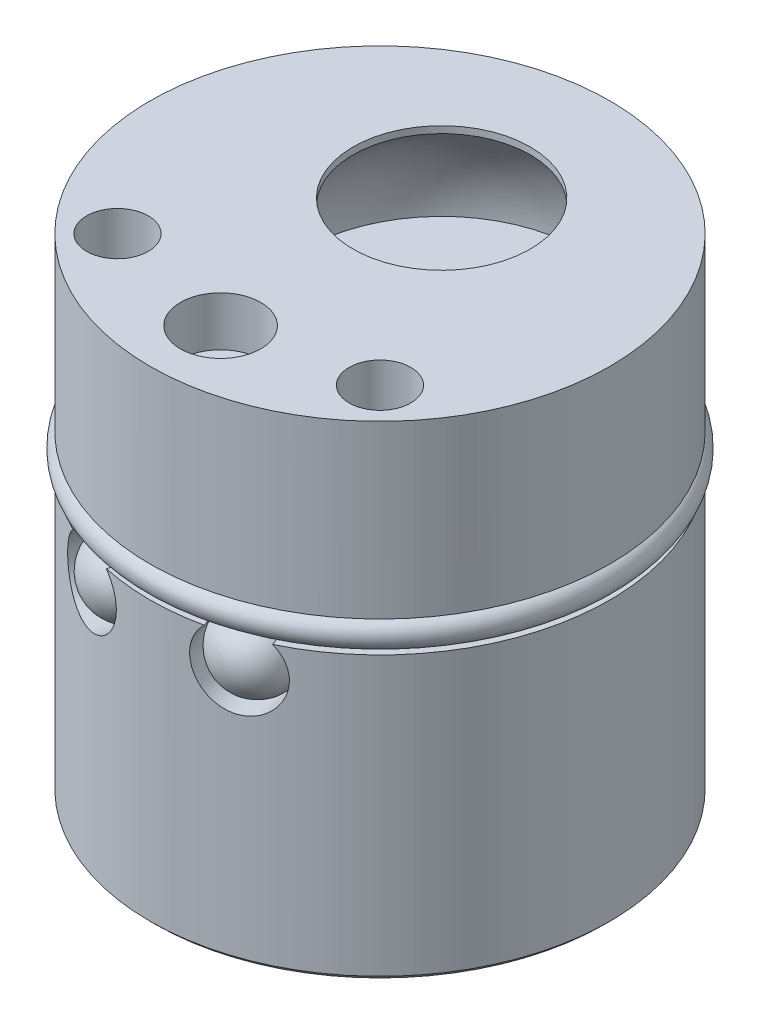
ISO-10303-21;
HEADER;
FILE_DESCRIPTION(('STEP AP214'),'2;1');
FILE_NAME('part.step','',(''),(''),'','','');
FILE_SCHEMA(('AUTOMOTIVE_DESIGN { 1 0 10303 214 1 1 1 1 }'));
ENDSEC;
DATA;
#1=APPLICATION_CONTEXT('core data for automotive mechanical design processes');
#2=APPLICATION_PROTOCOL_DEFINITION('international standard','automotive_design',2000,#1);
#3=PRODUCT_CONTEXT('',#1,'mechanical');
#4=PRODUCT('Part','Part','',(#3));
#5=PRODUCT_RELATED_PRODUCT_CATEGORY('part','',(#4));
#6=PRODUCT_DEFINITION_FORMATION('','',#4);
#7=PRODUCT_DEFINITION_CONTEXT('part definition',#1,'design');
#8=PRODUCT_DEFINITION('design','',#6,#7);
#9=PRODUCT_DEFINITION_SHAPE('','',#8);
#10=(LENGTH_UNIT() NAMED_UNIT(*) SI_UNIT(.MILLI.,.METRE.));
#11=(NAMED_UNIT(*) PLANE_ANGLE_UNIT() SI_UNIT($,.RADIAN.));
#12=(NAMED_UNIT(*) SI_UNIT($,.STERADIAN.) SOLID_ANGLE_UNIT());
#13=UNCERTAINTY_MEASURE_WITH_UNIT(LENGTH_MEASURE(1.E-05),#10,'distance_accuracy_value','');
#14=(GEOMETRIC_REPRESENTATION_CONTEXT(3) GLOBAL_UNCERTAINTY_ASSIGNED_CONTEXT((#13)) GLOBAL_UNIT_ASSIGNED_CONTEXT((#10,
#11,#12)) REPRESENTATION_CONTEXT('',''));
#15=CARTESIAN_POINT('',(0.,0.,0.));
#16=DIRECTION('',(0.,0.,1.));
#17=DIRECTION('',(1.,0.,0.));
#18=AXIS2_PLACEMENT_3D('',#15,#16,#17);
#19=CARTESIAN_POINT('',(3.31604188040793,13.1064,9.63048489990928));
#20=DIRECTION('',(0.,-1.,0.));
#21=DIRECTION('',(0.945518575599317,0.,-0.325568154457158));
#22=AXIS2_PLACEMENT_3D('',#19,#20,#21);
#23=SPHERICAL_SURFACE('',#22,1.9812);
#24=CARTESIAN_POINT('',(3.31604188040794,11.1252,9.63048489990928));
#25=VERTEX_POINT('',#24);
#26=VERTEX_LOOP('',#25);
#27=FACE_BOUND('',#26,.T.);
#28=ADVANCED_FACE('F35',(#27),#23,.T.);
#29=CLOSED_SHELL('',(#28));
#30=MANIFOLD_SOLID_BREP('B2',#29);
#31=CARTESIAN_POINT('',(-3.31604188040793,13.1064,9.63048489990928));
#32=DIRECTION('',(0.,-1.,0.));
#33=DIRECTION('',(0.945518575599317,0.,0.325568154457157));
#34=AXIS2_PLACEMENT_3D('',#31,#32,#33);
#35=SPHERICAL_SURFACE('',#34,1.9812);
#36=CARTESIAN_POINT('',(-3.31604188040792,11.1252,9.63048489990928));
#37=VERTEX_POINT('',#36);
#38=VERTEX_LOOP('',#37);
#39=FACE_BOUND('',#38,.T.);
#40=ADVANCED_FACE('F57',(#39),#35,.T.);
#41=CLOSED_SHELL('',(#40));
#42=MANIFOLD_SOLID_BREP('B6',#41);
#43=CARTESIAN_POINT('',(0.,15.4304999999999,0.));
#44=DIRECTION('',(0.,-1.,0.));
#45=DIRECTION('',(1.,0.,0.));
#46=AXIS2_PLACEMENT_3D('',#43,#44,#45);
#47=TOROIDAL_SURFACE('',#46,11.3792000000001,0.749299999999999);
#48=CARTESIAN_POINT('',(5.76304056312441,15.0221426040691,10.5340474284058));
#49=CARTESIAN_POINT('',(5.70489374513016,15.0063045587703,10.5540689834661));
#50=CARTESIAN_POINT('',(5.64635523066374,14.9922292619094,10.5742254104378));
#51=CARTESIAN_POINT('',(5.52876908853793,14.9669252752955,10.614713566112));
#52=CARTESIAN_POINT('',(5.46972185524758,14.9556945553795,10.6350451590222));
#53=CARTESIAN_POINT('',(5.35144977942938,14.9354043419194,10.6757695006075));
#54=CARTESIAN_POINT('',(5.29222569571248,14.9263397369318,10.696161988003));
#55=CARTESIAN_POINT('',(5.17355169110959,14.90995518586,10.7370247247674));
#56=CARTESIAN_POINT('',(5.11410172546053,14.9026356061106,10.7574949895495));
#57=CARTESIAN_POINT('',(4.93633599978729,14.8829168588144,10.8187046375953));
#58=CARTESIAN_POINT('',(4.81781125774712,14.8726310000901,10.8595159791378));
#59=CARTESIAN_POINT('',(4.58040334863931,14.8562313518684,10.9412620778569));
#60=CARTESIAN_POINT('',(4.46151994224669,14.8501217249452,10.9821969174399));
#61=CARTESIAN_POINT('',(4.24274614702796,14.8420319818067,11.0575267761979));
#62=CARTESIAN_POINT('',(4.14287187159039,14.8395462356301,11.0919162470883));
#63=CARTESIAN_POINT('',(3.94309853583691,14.8367757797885,11.1607037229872));
#64=CARTESIAN_POINT('',(3.84319947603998,14.8364910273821,11.195101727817));
#65=CARTESIAN_POINT('',(3.643515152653,14.8380964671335,11.2638585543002));
#66=CARTESIAN_POINT('',(3.54372987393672,14.83998451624,11.298217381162));
#67=CARTESIAN_POINT('',(3.34420539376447,14.8460943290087,11.3669191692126));
#68=CARTESIAN_POINT('',(3.24446620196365,14.8503164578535,11.4012621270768));
#69=CARTESIAN_POINT('',(3.04400573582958,14.8615309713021,11.4702862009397));
#70=CARTESIAN_POINT('',(2.94328595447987,14.8685538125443,11.5049668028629));
#71=CARTESIAN_POINT('',(2.74214384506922,14.8860308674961,11.5742255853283));
#72=CARTESIAN_POINT('',(2.64172140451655,14.8964835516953,11.6088038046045));
#73=CARTESIAN_POINT('',(2.49134375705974,14.9156095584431,11.6605829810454));
#74=CARTESIAN_POINT('',(2.44119390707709,14.9225709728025,11.6778509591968));
#75=CARTESIAN_POINT('',(2.34108799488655,14.937867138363,11.7123201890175));
#76=CARTESIAN_POINT('',(2.29113190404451,14.9462016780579,11.7295214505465));
#77=CARTESIAN_POINT('',(2.19141110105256,14.9645335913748,11.763858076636));
#78=CARTESIAN_POINT('',(2.14164677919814,14.9745333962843,11.7809933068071));
#79=CARTESIAN_POINT('',(2.04251451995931,14.9966428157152,11.8151272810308));
#80=CARTESIAN_POINT('',(1.99314680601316,15.0087535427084,11.8321259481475));
#81=CARTESIAN_POINT('',(1.94406924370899,15.0221426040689,11.8490247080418));
#82=B_SPLINE_CURVE_WITH_KNOTS('',3,(#48,#49,#50,#51,#52,#53,#54,#55,#56,#57,#58,#59,#60,#61,#62,
#63,#64,#65,#66,#67,#68,#69,#70,#71,#72,#73,#74,#75,#76,#77,#78,#79,#80,#81),.UNSPECIFIED.,.F.,
.F.,(4,2,2,2,2,2,2,2,2,2,2,2,2,2,2,2,4),(0.,0.190430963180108,0.380725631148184,
0.570566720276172,0.760447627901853,1.13766708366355,1.51526197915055,1.83221300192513,
2.14915786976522,2.46579040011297,2.78247248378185,3.10269660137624,3.42277811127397,
3.58324698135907,3.74369115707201,3.90437166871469,4.06513711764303),.UNSPECIFIED.);
#83=CARTESIAN_POINT('',(4.78253775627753,14.8705552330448,10.8716616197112));
#84=VERTEX_POINT('',#83);
#85=CARTESIAN_POINT('',(2.92457205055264,14.8705552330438,11.5114105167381));
#86=VERTEX_POINT('',#85);
#87=EDGE_CURVE('E95',#84,#86,#82,.T.);
#88=ORIENTED_EDGE('',*,*,#87,.F.);
#89=CARTESIAN_POINT('',(2.46109523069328,14.7286299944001,10.8410009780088));
#90=CARTESIAN_POINT('',(2.46640818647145,14.7405005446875,10.807236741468));
#91=CARTESIAN_POINT('',(2.4751612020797,14.7541367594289,10.7746165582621));
#92=CARTESIAN_POINT('',(2.49868782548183,14.783402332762,10.7125914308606));
#93=CARTESIAN_POINT('',(2.51347919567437,14.7990374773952,10.6831962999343));
#94=CARTESIAN_POINT('',(2.55202449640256,14.8346985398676,10.6212360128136));
#95=CARTESIAN_POINT('',(2.57707394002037,14.8548834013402,10.5895829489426));
#96=CARTESIAN_POINT('',(2.63258970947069,14.8943780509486,10.5308771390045));
#97=CARTESIAN_POINT('',(2.6630643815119,14.9136864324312,10.5038316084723));
#98=CARTESIAN_POINT('',(2.72207858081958,14.947132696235,10.4578875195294));
#99=CARTESIAN_POINT('',(2.74999516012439,14.9615788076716,10.4383960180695));
#100=CARTESIAN_POINT('',(2.8078271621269,14.988895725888,10.4013447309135));
#101=CARTESIAN_POINT('',(2.83774386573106,15.0017655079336,10.3837862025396));
#102=CARTESIAN_POINT('',(2.89913565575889,15.0257511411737,10.3501447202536));
#103=CARTESIAN_POINT('',(2.93061330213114,15.0368639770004,10.3340643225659));
#104=CARTESIAN_POINT('',(2.99472621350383,15.0572029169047,10.3030521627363));
#105=CARTESIAN_POINT('',(3.02736178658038,15.0664285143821,10.2881207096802));
#106=CARTESIAN_POINT('',(3.10828088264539,15.0866080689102,10.252650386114));
#107=CARTESIAN_POINT('',(3.15704204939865,15.0964931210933,10.2325862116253));
#108=CARTESIAN_POINT('',(3.25573404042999,15.1120557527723,10.1937158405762));
#109=CARTESIAN_POINT('',(3.30566531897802,15.1177316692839,10.1749101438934));
#110=CARTESIAN_POINT('',(3.40629842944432,15.1248301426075,10.1382718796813));
#111=CARTESIAN_POINT('',(3.45700162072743,15.1262440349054,10.1204413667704));
#112=CARTESIAN_POINT('',(3.55868922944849,15.1247821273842,10.0858246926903));
#113=CARTESIAN_POINT('',(3.60967358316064,15.1219072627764,10.0690383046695));
#114=CARTESIAN_POINT('',(3.71220160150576,15.1118391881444,10.0366409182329));
#115=CARTESIAN_POINT('',(3.76374538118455,15.1045998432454,10.0210445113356));
#116=CARTESIAN_POINT('',(3.86666260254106,15.0858261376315,9.99185689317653));
#117=CARTESIAN_POINT('',(3.91803591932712,15.0742891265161,9.9782669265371));
#118=CARTESIAN_POINT('',(4.02012532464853,15.0471438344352,9.95418825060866));
#119=CARTESIAN_POINT('',(4.07084347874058,15.0315585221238,9.94368273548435));
#120=CARTESIAN_POINT('',(4.1716601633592,14.996602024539,9.92715725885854));
#121=CARTESIAN_POINT('',(4.22175961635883,14.9772374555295,9.92112954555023));
#122=CARTESIAN_POINT('',(4.30788185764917,14.9409242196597,9.91636289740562));
#123=CARTESIAN_POINT('',(4.34411820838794,14.9246942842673,9.91611621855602));
#124=CARTESIAN_POINT('',(4.41583497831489,14.8910352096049,9.92025854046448));
#125=CARTESIAN_POINT('',(4.45131497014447,14.8736054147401,9.92465009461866));
#126=CARTESIAN_POINT('',(4.5214091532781,14.8381825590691,9.93940680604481));
#127=CARTESIAN_POINT('',(4.55600542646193,14.8201850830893,9.94985104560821));
#128=CARTESIAN_POINT('',(4.62275175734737,14.7853453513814,9.97799008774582));
#129=CARTESIAN_POINT('',(4.65490909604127,14.7684996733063,9.99566221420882));
#130=CARTESIAN_POINT('',(4.70548556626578,14.7429000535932,10.031718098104));
#131=CARTESIAN_POINT('',(4.72497346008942,14.7332954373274,10.0480047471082));
#132=CARTESIAN_POINT('',(4.76165213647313,14.7161401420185,10.0839208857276));
#133=CARTESIAN_POINT('',(4.7788440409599,14.7085884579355,10.1035487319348));
#134=CARTESIAN_POINT('',(4.81047954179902,14.69605051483,10.1457421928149));
#135=CARTESIAN_POINT('',(4.82491454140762,14.6910722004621,10.1683166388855));
#136=CARTESIAN_POINT('',(4.85058639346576,14.6840285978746,10.2156362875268));
#137=CARTESIAN_POINT('',(4.8618228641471,14.6819636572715,10.2403817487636));
#138=CARTESIAN_POINT('',(4.88044142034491,14.6808154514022,10.2900600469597));
#139=CARTESIAN_POINT('',(4.88797466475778,14.6816017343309,10.3149339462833));
#140=CARTESIAN_POINT('',(4.89986925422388,14.6856974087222,10.3652157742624));
#141=CARTESIAN_POINT('',(4.90423030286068,14.6890070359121,10.3906237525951));
#142=CARTESIAN_POINT('',(4.91002712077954,14.6981496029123,10.4431547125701));
#143=CARTESIAN_POINT('',(4.91123841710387,14.704141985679,10.4702741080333));
#144=CARTESIAN_POINT('',(4.91025915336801,14.7181845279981,10.5239027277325));
#145=CARTESIAN_POINT('',(4.90806665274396,14.7262358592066,10.5504115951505));
#146=CARTESIAN_POINT('',(4.89889840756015,14.7476298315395,10.6134471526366));
#147=CARTESIAN_POINT('',(4.89029197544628,14.7617702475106,10.6494695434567));
#148=CARTESIAN_POINT('',(4.86741936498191,14.7918120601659,10.7188807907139));
#149=CARTESIAN_POINT('',(4.85314309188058,14.8077165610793,10.752264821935));
#150=CARTESIAN_POINT('',(4.81383467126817,14.8458367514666,10.8275082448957));
#151=CARTESIAN_POINT('',(4.78678410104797,14.8682943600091,10.8681869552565));
#152=CARTESIAN_POINT('',(4.72573531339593,14.9121225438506,10.9445760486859));
#153=CARTESIAN_POINT('',(4.69172537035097,14.9334912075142,10.9802778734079));
#154=CARTESIAN_POINT('',(4.60311234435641,14.982127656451,11.0613134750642));
#155=CARTESIAN_POINT('',(4.54583271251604,15.0081444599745,11.1044638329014));
#156=CARTESIAN_POINT('',(4.42422182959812,15.0529993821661,11.1839200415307));
#157=CARTESIAN_POINT('',(4.35988217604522,15.0718288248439,11.220217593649));
#158=CARTESIAN_POINT('',(4.22449041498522,15.1018353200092,11.2884586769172));
#159=CARTESIAN_POINT('',(4.15328702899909,15.1127399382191,11.3202194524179));
#160=CARTESIAN_POINT('',(4.00797929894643,15.1254318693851,11.378629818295));
#161=CARTESIAN_POINT('',(3.93387332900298,15.1272139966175,11.4052764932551));
#162=CARTESIAN_POINT('',(3.81386092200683,15.1227156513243,11.443662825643));
#163=CARTESIAN_POINT('',(3.76837305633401,15.1193407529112,11.4571342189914));
#164=CARTESIAN_POINT('',(3.6771292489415,15.1092803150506,11.4818292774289));
#165=CARTESIAN_POINT('',(3.63137323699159,15.1025938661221,11.4930523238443));
#166=CARTESIAN_POINT('',(3.53990045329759,15.0860105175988,11.5128444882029));
#167=CARTESIAN_POINT('',(3.4941836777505,15.0761160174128,11.5214155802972));
#168=CARTESIAN_POINT('',(3.40304125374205,15.0532991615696,11.535357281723));
#169=CARTESIAN_POINT('',(3.35761545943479,15.0403784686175,11.5407296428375));
#170=CARTESIAN_POINT('',(3.25396050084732,15.0075585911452,11.5485876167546));
#171=CARTESIAN_POINT('',(3.19591317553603,14.9867254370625,11.5497516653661));
#172=CARTESIAN_POINT('',(3.08167926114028,14.941556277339,11.5435784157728));
#173=CARTESIAN_POINT('',(3.02548931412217,14.9172270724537,11.5362574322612));
#174=CARTESIAN_POINT('',(2.93056250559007,14.87363859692,11.5142268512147));
#175=CARTESIAN_POINT('',(2.89110937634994,14.8547206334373,11.5019549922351));
#176=CARTESIAN_POINT('',(2.81470168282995,14.8173195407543,11.4706978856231));
#177=CARTESIAN_POINT('',(2.77774413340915,14.7988359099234,11.4517208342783));
#178=CARTESIAN_POINT('',(2.71536900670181,14.7679298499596,11.4115801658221));
#179=CARTESIAN_POINT('',(2.6892282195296,14.7550804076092,11.3918740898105));
#180=CARTESIAN_POINT('',(2.63978592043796,14.731622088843,11.348039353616));
#181=CARTESIAN_POINT('',(2.61648129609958,14.7210107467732,11.323915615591));
#182=CARTESIAN_POINT('',(2.57708842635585,14.7045348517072,11.2758694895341));
#183=CARTESIAN_POINT('',(2.56044418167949,14.6981753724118,11.2525744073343));
#184=CARTESIAN_POINT('',(2.53024997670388,14.6882842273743,11.2034908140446));
#185=CARTESIAN_POINT('',(2.51669900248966,14.684751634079,11.1777031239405));
#186=CARTESIAN_POINT('',(2.49320186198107,14.6809353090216,11.1241088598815));
#187=CARTESIAN_POINT('',(2.48327717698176,14.680670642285,11.0962913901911));
#188=CARTESIAN_POINT('',(2.46769065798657,14.6836336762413,11.0396690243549));
#189=CARTESIAN_POINT('',(2.46202566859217,14.6868587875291,11.0108648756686));
#190=CARTESIAN_POINT('',(2.45587390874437,14.6958020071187,10.9581733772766));
#191=CARTESIAN_POINT('',(2.45467346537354,14.701006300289,10.9342782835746));
#192=CARTESIAN_POINT('',(2.45549199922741,14.713415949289,10.8870822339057));
#193=CARTESIAN_POINT('',(2.45751065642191,14.720621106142,10.8637812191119));
#194=CARTESIAN_POINT('',(2.46109523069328,14.7286299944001,10.8410009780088));
#195=B_SPLINE_CURVE_WITH_KNOTS('',3,(#89,#90,#91,#92,#93,#94,#95,#96,#97,#98,#99,#100,#101,#102,
#103,#104,#105,#106,#107,#108,#109,#110,#111,#112,#113,#114,#115,#116,#117,#118,#119,#120,#121,
#122,#123,#124,#125,#126,#127,#128,#129,#130,#131,#132,#133,#134,#135,#136,#137,#138,#139,#140,
#141,#142,#143,#144,#145,#146,#147,#148,#149,#150,#151,#152,#153,#154,#155,#156,#157,#158,#159,
#160,#161,#162,#163,#164,#165,#166,#167,#168,#169,#170,#171,#172,#173,#174,#175,#176,#177,#178,
#179,#180,#181,#182,#183,#184,#185,#186,#187,#188,#189,#190,#191,#192,#193,#194),.UNSPECIFIED.,
.T.,.F.,(4,2,2,2,2,2,2,2,2,2,2,2,2,2,2,2,2,2,2,2,2,2,2,2,2,2,2,2,2,2,2,2,2,2,2,2,2,2,2,2,2,2,2,
2,2,2,2,2,2,2,2,2,4),(0.,0.10841096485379,0.217143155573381,0.351768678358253,0.486603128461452,
0.597409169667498,0.708286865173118,0.819352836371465,0.930448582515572,1.09117214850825,
1.25195918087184,1.4130728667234,1.57415142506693,1.73696327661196,1.89987570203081,
2.06188327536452,2.22360972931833,2.34249787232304,2.46145149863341,2.58199553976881,
2.70216426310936,2.78328593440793,2.86436781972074,2.9456985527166,3.02703898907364,
3.10470578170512,3.18237983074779,3.26545444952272,3.34857644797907,3.46684989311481,
3.58533486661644,3.74574323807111,3.9064241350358,4.13404341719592,4.361936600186,
4.59733488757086,4.83286697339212,4.97540268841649,5.11797757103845,5.26044606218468,
5.40283645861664,5.58728945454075,5.77138837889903,5.907263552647,6.04297320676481,
6.14808686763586,6.25308411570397,6.34070601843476,6.42829915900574,6.51640307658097,
6.60444166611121,6.67759224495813,6.75073555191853),.UNSPECIFIED.);
#196=EDGE_CURVE('E109',#86,#84,#195,.T.);
#197=ORIENTED_EDGE('',*,*,#196,.F.);
#198=EDGE_LOOP('',(#88,#197));
#199=FACE_BOUND('',#198,.T.);
#200=CARTESIAN_POINT('',(-1.94406924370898,15.0221426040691,11.8490247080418));
#201=CARTESIAN_POINT('',(-2.00221606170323,15.0063045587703,11.8290031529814));
#202=CARTESIAN_POINT('',(-2.06075457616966,14.9922292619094,11.8088467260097));
#203=CARTESIAN_POINT('',(-2.17834071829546,14.9669252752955,11.7683585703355));
#204=CARTESIAN_POINT('',(-2.23738795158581,14.9556945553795,11.7480269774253));
#205=CARTESIAN_POINT('',(-2.35566002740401,14.9354043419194,11.70730263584));
#206=CARTESIAN_POINT('',(-2.41488411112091,14.9263397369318,11.6869101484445));
#207=CARTESIAN_POINT('',(-2.5335581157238,14.90995518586,11.6460474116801));
#208=CARTESIAN_POINT('',(-2.59300808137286,14.9026356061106,11.625577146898));
#209=CARTESIAN_POINT('',(-2.77077380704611,14.8829168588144,11.5643674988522));
#210=CARTESIAN_POINT('',(-2.88929854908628,14.8726310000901,11.5235561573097));
#211=CARTESIAN_POINT('',(-3.12670645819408,14.8562313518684,11.4418100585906));
#212=CARTESIAN_POINT('',(-3.2455898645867,14.8501217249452,11.4008752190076));
#213=CARTESIAN_POINT('',(-3.46436365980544,14.8420319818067,11.3255453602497));
#214=CARTESIAN_POINT('',(-3.56423793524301,14.8395462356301,11.2911558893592));
#215=CARTESIAN_POINT('',(-3.76401127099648,14.8367757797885,11.2223684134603));
#216=CARTESIAN_POINT('',(-3.86391033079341,14.8364910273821,11.1879704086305));
#217=CARTESIAN_POINT('',(-4.0635946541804,14.8380964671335,11.1192135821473));
#218=CARTESIAN_POINT('',(-4.16337993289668,14.83998451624,11.0848547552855));
#219=CARTESIAN_POINT('',(-4.36290441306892,14.8460943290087,11.0161529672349));
#220=CARTESIAN_POINT('',(-4.46264360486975,14.8503164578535,10.9818100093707));
#221=CARTESIAN_POINT('',(-4.66310407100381,14.8615309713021,10.9127859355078));
#222=CARTESIAN_POINT('',(-4.76382385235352,14.8685538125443,10.8781053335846));
#223=CARTESIAN_POINT('',(-4.96496596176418,14.8860308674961,10.8088465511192));
#224=CARTESIAN_POINT('',(-5.06538840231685,14.8964835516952,10.774268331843));
#225=CARTESIAN_POINT('',(-5.21576604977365,14.9156095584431,10.7224891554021));
#226=CARTESIAN_POINT('',(-5.2659158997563,14.9225709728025,10.7052211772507));
#227=CARTESIAN_POINT('',(-5.36602181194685,14.937867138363,10.67075194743));
#228=CARTESIAN_POINT('',(-5.41597790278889,14.9462016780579,10.653550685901));
#229=CARTESIAN_POINT('',(-5.51569870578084,14.9645335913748,10.6192140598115));
#230=CARTESIAN_POINT('',(-5.56546302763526,14.9745333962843,10.6020788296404));
#231=CARTESIAN_POINT('',(-5.66459528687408,14.9966428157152,10.5679448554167));
#232=CARTESIAN_POINT('',(-5.71396300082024,15.0087535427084,10.5509461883));
#233=CARTESIAN_POINT('',(-5.7630405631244,15.0221426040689,10.5340474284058));
#234=B_SPLINE_CURVE_WITH_KNOTS('',3,(#200,#201,#202,#203,#204,#205,#206,#207,#208,#209,#210,
#211,#212,#213,#214,#215,#216,#217,#218,#219,#220,#221,#222,#223,#224,#225,#226,#227,#228,#229,
#230,#231,#232,#233),.UNSPECIFIED.,.F.,.F.,(4,2,2,2,2,2,2,2,2,2,2,2,2,2,2,2,4),(0.,
0.190430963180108,0.380725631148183,0.57056672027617,0.760447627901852,1.13766708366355,
1.51526197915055,1.83221300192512,2.14915786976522,2.46579040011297,2.78247248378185,
3.10269660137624,3.42277811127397,3.58324698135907,3.74369115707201,3.90437166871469,
4.06513711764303),.UNSPECIFIED.);
#235=CARTESIAN_POINT('',(-2.92457205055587,14.8705552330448,11.5114105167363));
#236=VERTEX_POINT('',#235);
#237=CARTESIAN_POINT('',(-4.78253775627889,14.8705552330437,10.8716616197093));
#238=VERTEX_POINT('',#237);
#239=EDGE_CURVE('E55',#236,#238,#234,.T.);
#240=ORIENTED_EDGE('',*,*,#239,.F.);
#241=CARTESIAN_POINT('',(-4.73501714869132,14.7286299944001,10.0580268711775));
#242=CARTESIAN_POINT('',(-4.71004314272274,14.7405005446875,10.0346912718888));
#243=CARTESIAN_POINT('',(-4.68306268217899,14.7541367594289,10.0143751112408));
#244=CARTESIAN_POINT('',(-4.6263369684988,14.783402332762,9.97998307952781));
#245=CARTESIAN_POINT('',(-4.59658376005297,14.7990374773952,9.96592587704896));
#246=CARTESIAN_POINT('',(-4.52806308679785,14.8346985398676,9.9408313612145));
#247=CARTESIAN_POINT('',(-4.48883628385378,14.8548834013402,9.93131038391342));
#248=CARTESIAN_POINT('',(-4.40894635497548,14.8943780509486,9.91922849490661));
#249=CARTESIAN_POINT('',(-4.36828109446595,14.9136864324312,9.9166784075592));
#250=CARTESIAN_POINT('',(-4.29349126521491,14.947132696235,9.91680674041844));
#251=CARTESIAN_POINT('',(-4.25949253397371,14.9615788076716,9.91863439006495));
#252=CARTESIAN_POINT('',(-4.19110924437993,14.988895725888,9.92504251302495));
#253=CARTESIAN_POINT('',(-4.1567244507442,15.0017655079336,9.92962476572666));
#254=CARTESIAN_POINT('',(-4.08763529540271,15.0257511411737,9.94091147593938));
#255=CARTESIAN_POINT('',(-4.05293049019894,15.0368639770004,9.94761952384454));
#256=CARTESIAN_POINT('',(-3.9833158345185,15.0572029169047,9.96265345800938));
#257=CARTESIAN_POINT('',(-3.94840593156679,15.0664285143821,9.97097977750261));
#258=CARTESIAN_POINT('',(-3.86280310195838,15.0866080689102,9.99284755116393));
#259=CARTESIAN_POINT('',(-3.81202603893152,15.0964931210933,10.0070571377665));
#260=CARTESIAN_POINT('',(-3.71032469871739,15.1120557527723,10.0371877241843));
#261=CARTESIAN_POINT('',(-3.65940037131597,15.1177316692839,10.053109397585));
#262=CARTESIAN_POINT('',(-3.55754363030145,15.1248301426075,10.0861939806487));
#263=CARTESIAN_POINT('',(-3.5066114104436,15.1262440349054,10.1033593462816));
#264=CARTESIAN_POINT('',(-3.40516832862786,15.1247821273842,10.13868617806));
#265=CARTESIAN_POINT('',(-3.35465737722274,15.1219072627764,10.1568474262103));
#266=CARTESIAN_POINT('',(-3.25391837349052,15.1118391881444,10.1944404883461));
#267=CARTESIAN_POINT('',(-3.20369921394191,15.1045998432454,10.2138838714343));
#268=CARTESIAN_POINT('',(-3.10462964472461,15.0858261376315,10.2542458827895));
#269=CARTESIAN_POINT('',(-3.0557800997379,15.0742891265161,10.2751654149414));
#270=CARTESIAN_POINT('',(-2.96050823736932,15.0471438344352,10.3190436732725));
#271=CARTESIAN_POINT('',(-2.91407394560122,15.0315585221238,10.3419904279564));
#272=CARTESIAN_POINT('',(-2.82445521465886,14.996602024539,10.3910371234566));
#273=CARTESIAN_POINT('',(-2.7812652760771,14.9772374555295,10.4171315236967));
#274=CARTESIAN_POINT('',(-2.71046538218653,14.9409242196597,10.4663974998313));
#275=CARTESIAN_POINT('',(-2.68175887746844,14.9246942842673,10.4885124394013));
#276=CARTESIAN_POINT('',(-2.6277955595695,14.8910352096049,10.5359298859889));
#277=CARTESIAN_POINT('',(-2.60254065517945,14.8736054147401,10.5612341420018));
#278=CARTESIAN_POINT('',(-2.55639082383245,14.8381825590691,10.6160168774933));
#279=CARTESIAN_POINT('',(-2.53555870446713,14.8201850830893,10.6455466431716));
#280=CARTESIAN_POINT('',(-2.50028600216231,14.7853453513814,10.7088136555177));
#281=CARTESIAN_POINT('',(-2.48582572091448,14.7684996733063,10.7425375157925));
#282=CARTESIAN_POINT('',(-2.46816913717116,14.7429000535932,10.8020879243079));
#283=CARTESIAN_POINT('',(-2.46283952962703,14.7332954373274,10.8269199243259));
#284=CARTESIAN_POINT('',(-2.45604852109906,14.7161401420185,10.8778038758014));
#285=CARTESIAN_POINT('',(-2.45458522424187,14.7085884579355,10.9038552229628));
#286=CARTESIAN_POINT('',(-2.45563299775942,14.69605051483,10.9565808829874));
#287=CARTESIAN_POINT('',(-2.45815627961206,14.6910722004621,10.9832568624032));
#288=CARTESIAN_POINT('',(-2.46705946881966,14.6840285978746,11.0363504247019));
#289=CARTESIAN_POINT('',(-2.47343983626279,14.6819636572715,11.0627679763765));
#290=CARTESIAN_POINT('',(-2.4893532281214,14.6808154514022,11.1133777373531));
#291=CARTESIAN_POINT('',(-2.49873085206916,14.6816017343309,11.1376165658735));
#292=CARTESIAN_POINT('',(-2.52031437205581,14.6856974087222,11.1845622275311));
#293=CARTESIAN_POINT('',(-2.5325205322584,14.6890070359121,11.2072689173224));
#294=CARTESIAN_POINT('',(-2.56029386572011,14.6981496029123,11.2522327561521));
#295=CARTESIAN_POINT('',(-2.5760357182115,14.704141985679,11.2743488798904));
#296=CARTESIAN_POINT('',(-2.60982446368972,14.7181845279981,11.3160059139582));
#297=CARTESIAN_POINT('',(-2.62787266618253,14.7262358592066,11.3355453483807));
#298=CARTESIAN_POINT('',(-2.67390590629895,14.7476298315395,11.3795735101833));
#299=CARTESIAN_POINT('',(-2.70286546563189,14.7617702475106,11.4026608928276));
#300=CARTESIAN_POINT('',(-2.76362315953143,14.7918120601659,11.4432759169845));
#301=CARTESIAN_POINT('',(-2.79542627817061,14.8077165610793,11.4607935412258));
#302=CARTESIAN_POINT('',(-2.87272621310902,14.8458367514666,11.49588548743));
#303=CARTESIAN_POINT('',(-2.9190866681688,14.8682943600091,11.511286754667));
#304=CARTESIAN_POINT('',(-3.0142235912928,14.9121225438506,11.5338967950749));
#305=CARTESIAN_POINT('',(-3.06300403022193,14.9334912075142,11.5410916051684));
#306=CARTESIAN_POINT('',(-3.18272254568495,14.982127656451,11.5503929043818));
#307=CARTESIAN_POINT('',(-3.25442552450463,15.0081444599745,11.5491309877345));
#308=CARTESIAN_POINT('',(-3.3991743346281,15.0529993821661,11.5368721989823));
#309=CARTESIAN_POINT('',(-3.47222167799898,15.0718288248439,11.5258636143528));
#310=CARTESIAN_POINT('',(-3.62092524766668,15.1018353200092,11.4962828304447));
#311=CARTESIAN_POINT('',(-3.69658816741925,15.1127399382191,11.4774734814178));
#312=CARTESIAN_POINT('',(-3.8470532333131,15.1254318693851,11.4340411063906));
#313=CARTESIAN_POINT('',(-3.92185486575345,15.1272139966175,11.4094147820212));
#314=CARTESIAN_POINT('',(-4.04005891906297,15.1227156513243,11.3657766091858));
#315=CARTESIAN_POINT('',(-4.0841976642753,15.1193407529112,11.3483870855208));
#316=CARTESIAN_POINT('',(-4.17130256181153,15.1092803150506,11.3116717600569));
#317=CARTESIAN_POINT('',(-4.21426838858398,15.1025938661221,11.2923454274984));
#318=CARTESIAN_POINT('',(-4.2985351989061,15.0860105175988,11.2516255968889));
#319=CARTESIAN_POINT('',(-4.33983740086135,15.0761160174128,11.2302336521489));
#320=CARTESIAN_POINT('',(-4.42024197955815,15.0532991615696,11.1851069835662));
#321=CARTESIAN_POINT('',(-4.45934554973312,15.0403784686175,11.1613735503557));
#322=CARTESIAN_POINT('',(-4.54586462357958,15.0075585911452,11.1037493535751));
#323=CARTESIAN_POINT('',(-4.59232320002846,14.9867254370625,11.0689291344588));
#324=CARTESIAN_POINT('',(-4.67854012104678,14.941556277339,10.9937351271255));
#325=CARTESIAN_POINT('',(-4.71831115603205,14.9172270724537,10.9533721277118));
#326=CARTESIAN_POINT('',(-4.77955112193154,14.87363859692,10.8775690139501));
#327=CARTESIAN_POINT('',(-4.80308530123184,14.8547206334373,10.8436088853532));
#328=CARTESIAN_POINT('',(-4.84405158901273,14.8173195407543,10.7719366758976));
#329=CARTESIAN_POINT('',(-4.861491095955,14.7988359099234,10.7342292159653));
#330=CARTESIAN_POINT('',(-4.88593030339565,14.7679298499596,10.6641959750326));
#331=CARTESIAN_POINT('',(-4.89439725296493,14.7550804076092,10.6325734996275));
#332=CARTESIAN_POINT('',(-4.90637095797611,14.731622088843,10.5675915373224));
#333=CARTESIAN_POINT('',(-4.90988319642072,14.7210107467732,10.5342340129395));
#334=CARTESIAN_POINT('',(-4.91134505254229,14.7045348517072,10.4721204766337));
#335=CARTESIAN_POINT('',(-4.91011901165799,14.6981753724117,10.443516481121));
#336=CARTESIAN_POINT('',(-4.90369349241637,14.6882842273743,10.3862486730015));
#337=CARTESIAN_POINT('',(-4.89849531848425,14.684751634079,10.3575848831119));
#338=CARTESIAN_POINT('',(-4.88401539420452,14.6809353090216,10.3008857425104));
#339=CARTESIAN_POINT('',(-4.87471000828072,14.680670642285,10.2728550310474));
#340=CARTESIAN_POINT('',(-4.85213214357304,14.6836336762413,10.218639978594));
#341=CARTESIAN_POINT('',(-4.83886261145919,14.6868587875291,10.1924542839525));
#342=CARTESIAN_POINT('',(-4.81127013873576,14.6958020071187,10.1471454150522));
#343=CARTESIAN_POINT('',(-4.79750481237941,14.701006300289,10.1275767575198));
#344=CARTESIAN_POINT('',(-4.7678030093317,14.713415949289,10.0908897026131));
#345=CARTESIAN_POINT('',(-4.75186674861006,14.720621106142,10.0737710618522));
#346=CARTESIAN_POINT('',(-4.73501714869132,14.7286299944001,10.0580268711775));
#347=B_SPLINE_CURVE_WITH_KNOTS('',3,(#241,#242,#243,#244,#245,#246,#247,#248,#249,#250,#251,
#252,#253,#254,#255,#256,#257,#258,#259,#260,#261,#262,#263,#264,#265,#266,#267,#268,#269,#270,
#271,#272,#273,#274,#275,#276,#277,#278,#279,#280,#281,#282,#283,#284,#285,#286,#287,#288,#289,
#290,#291,#292,#293,#294,#295,#296,#297,#298,#299,#300,#301,#302,#303,#304,#305,#306,#307,#308,
#309,#310,#311,#312,#313,#314,#315,#316,#317,#318,#319,#320,#321,#322,#323,#324,#325,#326,#327,
#328,#329,#330,#331,#332,#333,#334,#335,#336,#337,#338,#339,#340,#341,#342,#343,#344,#345,#346),
.UNSPECIFIED.,.T.,.F.,(4,2,2,2,2,2,2,2,2,2,2,2,2,2,2,2,2,2,2,2,2,2,2,2,2,2,2,2,2,2,2,2,2,2,2,2,
2,2,2,2,2,2,2,2,2,2,2,2,2,2,2,2,4),(0.,0.10841096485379,0.217143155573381,0.351768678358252,
0.486603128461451,0.597409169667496,0.708286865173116,0.819352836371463,0.93044858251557,
1.09117214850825,1.25195918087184,1.41307286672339,1.57415142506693,1.73696327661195,
1.8998757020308,2.06188327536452,2.22360972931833,2.34249787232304,2.46145149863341,
2.58199553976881,2.70216426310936,2.78328593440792,2.86436781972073,2.9456985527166,
3.02703898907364,3.10470578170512,3.18237983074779,3.26545444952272,3.34857644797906,
3.4668498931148,3.58533486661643,3.74574323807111,3.9064241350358,4.13404341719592,
4.361936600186,4.59733488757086,4.83286697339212,4.97540268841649,5.11797757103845,
5.26044606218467,5.40283645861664,5.58728945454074,5.77138837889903,5.907263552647,
6.04297320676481,6.14808686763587,6.25308411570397,6.34070601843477,6.42829915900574,
6.51640307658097,6.60444166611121,6.67759224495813,6.75073555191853),.UNSPECIFIED.);
#348=EDGE_CURVE('E89',#238,#236,#347,.T.);
#349=ORIENTED_EDGE('',*,*,#348,.F.);
#350=EDGE_LOOP('',(#240,#349));
#351=FACE_BOUND('',#350,.T.);
#352=ADVANCED_FACE('F78',(#199,#351),#47,.T.);
#353=CARTESIAN_POINT('',(-3.8535549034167,15.1257,11.1915360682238));
#354=DIRECTION('',(-0.325568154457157,0.,0.945518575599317));
#355=DIRECTION('',(0.945518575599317,0.,0.325568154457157));
#356=AXIS2_PLACEMENT_3D('',#353,#354,#355);
#357=PLANE('',#356);
#358=ORIENTED_EDGE('',*,*,#239,.T.);
#359=CARTESIAN_POINT('',(-3.8535549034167,13.1064,11.1915360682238));
#360=DIRECTION('',(-0.325568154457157,0.,0.945518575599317));
#361=DIRECTION('',(0.945518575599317,0.,0.325568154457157));
#362=AXIS2_PLACEMENT_3D('',#359,#360,#361);
#363=CIRCLE('',#362,2.01930000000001);
#364=EDGE_CURVE('E102',#236,#238,#363,.T.);
#365=ORIENTED_EDGE('',*,*,#364,.F.);
#366=EDGE_LOOP('',(#358,#365));
#367=FACE_BOUND('',#366,.T.);
#368=ADVANCED_FACE('F137',(#367),#357,.F.);
#369=CARTESIAN_POINT('',(-3.8535549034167,13.1064,11.1915360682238));
#370=DIRECTION('',(-0.325568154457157,0.,0.945518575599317));
#371=DIRECTION('',(0.945518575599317,0.,0.325568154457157));
#372=AXIS2_PLACEMENT_3D('',#369,#370,#371);
#373=CYLINDRICAL_SURFACE('',#372,2.01930000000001);
#374=ORIENTED_EDGE('',*,*,#348,.T.);
#375=ORIENTED_EDGE('',*,*,#364,.T.);
#376=EDGE_LOOP('',(#374,#375));
#377=FACE_BOUND('',#376,.T.);
#378=ADVANCED_FACE('F129',(#377),#373,.F.);
#379=CARTESIAN_POINT('',(3.8535549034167,15.1257,11.1915360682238));
#380=DIRECTION('',(0.325568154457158,0.,0.945518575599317));
#381=DIRECTION('',(0.945518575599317,0.,-0.325568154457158));
#382=AXIS2_PLACEMENT_3D('',#379,#380,#381);
#383=PLANE('',#382);
#384=ORIENTED_EDGE('',*,*,#87,.T.);
#385=CARTESIAN_POINT('',(3.8535549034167,13.1064,11.1915360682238));
#386=DIRECTION('',(0.325568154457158,0.,0.945518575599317));
#387=DIRECTION('',(0.945518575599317,0.,-0.325568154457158));
#388=AXIS2_PLACEMENT_3D('',#385,#386,#387);
#389=CIRCLE('',#388,2.01930000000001);
#390=EDGE_CURVE('E111',#84,#86,#389,.T.);
#391=ORIENTED_EDGE('',*,*,#390,.F.);
#392=EDGE_LOOP('',(#384,#391));
#393=FACE_BOUND('',#392,.T.);
#394=ADVANCED_FACE('F114',(#393),#383,.F.);
#395=CARTESIAN_POINT('',(3.8535549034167,13.1064,11.1915360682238));
#396=DIRECTION('',(0.325568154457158,0.,0.945518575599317));
#397=DIRECTION('',(0.945518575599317,0.,-0.325568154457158));
#398=AXIS2_PLACEMENT_3D('',#395,#396,#397);
#399=CYLINDRICAL_SURFACE('',#398,2.01930000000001);
#400=ORIENTED_EDGE('',*,*,#196,.T.);
#401=ORIENTED_EDGE('',*,*,#390,.T.);
#402=EDGE_LOOP('',(#400,#401));
#403=FACE_BOUND('',#402,.T.);
#404=ADVANCED_FACE('F110',(#403),#399,.F.);
#405=CLOSED_SHELL('',(#352,#368,#378,#394,#404));
#406=MANIFOLD_SOLID_BREP('B31',#405);
#407=CARTESIAN_POINT('',(11.8364,14.5796,0.));
#408=DIRECTION('',(0.,-1.,0.));
#409=DIRECTION('',(1.,0.,0.));
#410=AXIS2_PLACEMENT_3D('',#407,#408,#409);
#411=PLANE('',#410);
#412=CARTESIAN_POINT('',(0.,14.5796,0.));
#413=DIRECTION('',(0.,-1.,0.));
#414=DIRECTION('',(1.,0.,0.));
#415=AXIS2_PLACEMENT_3D('',#412,#413,#414);
#416=CIRCLE('',#415,10.6299);
#417=CARTESIAN_POINT('',(-4.7372184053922,14.5796,9.51596215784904));
#418=VERTEX_POINT('',#417);
#419=CARTESIAN_POINT('',(4.73721840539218,14.5796,9.51596215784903));
#420=VERTEX_POINT('',#419);
#421=EDGE_CURVE('E272',#418,#420,#416,.T.);
#422=ORIENTED_EDGE('',*,*,#421,.T.);
#423=DIRECTION('',(0.325568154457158,0.,0.945518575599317));
#424=VECTOR('',#423,1.);
#425=CARTESIAN_POINT('',(5.15934797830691,14.5795999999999,10.7419154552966));
#426=LINE('',#425,#424);
#427=CARTESIAN_POINT('',(5.13302793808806,14.5796000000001,10.6654765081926));
#428=VERTEX_POINT('',#427);
#429=EDGE_CURVE('E260',#420,#428,#426,.T.);
#430=ORIENTED_EDGE('',*,*,#429,.T.);
#431=CARTESIAN_POINT('',(0.,14.5796,0.));
#432=DIRECTION('',(0.,-1.,0.));
#433=DIRECTION('',(1.,0.,0.));
#434=AXIS2_PLACEMENT_3D('',#431,#432,#433);
#435=CIRCLE('',#434,11.8364);
#436=CARTESIAN_POINT('',(-5.13302793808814,14.5796,10.6654765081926));
#437=VERTEX_POINT('',#436);
#438=EDGE_CURVE('E270',#437,#428,#435,.T.);
#439=ORIENTED_EDGE('',*,*,#438,.F.);
#440=DIRECTION('',(-0.325568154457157,0.,0.945518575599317));
#441=VECTOR('',#440,1.);
#442=CARTESIAN_POINT('',(-5.15934797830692,14.5795999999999,10.7419154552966));
#443=LINE('',#442,#441);
#444=EDGE_CURVE('E206',#437,#418,#443,.F.);
#445=ORIENTED_EDGE('',*,*,#444,.T.);
#446=EDGE_LOOP('',(#422,#430,#439,#445));
#447=FACE_BOUND('',#446,.T.);
#448=ADVANCED_FACE('F179',(#447),#411,.F.);
#449=CARTESIAN_POINT('',(0.,24.9936,0.));
#450=DIRECTION('',(0.,-1.,0.));
#451=DIRECTION('',(0.,0.,-1.));
#452=AXIS2_PLACEMENT_3D('',#449,#450,#451);
#453=CYLINDRICAL_SURFACE('',#452,11.8364);
#454=CARTESIAN_POINT('',(0.,16.1798,0.));
#455=DIRECTION('',(0.,-1.,0.));
#456=DIRECTION('',(1.,0.,0.));
#457=AXIS2_PLACEMENT_3D('',#454,#455,#456);
#458=CIRCLE('',#457,11.8364000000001);
#459=CARTESIAN_POINT('',(11.8364,16.1798,0.));
#460=VERTEX_POINT('',#459);
#461=EDGE_CURVE('E417',#460,#460,#458,.T.);
#462=ORIENTED_EDGE('',*,*,#461,.F.);
#463=EDGE_LOOP('',(#462));
#464=FACE_BOUND('',#463,.T.);
#465=CARTESIAN_POINT('',(0.,24.9936,0.));
#466=DIRECTION('',(0.,1.,0.));
#467=DIRECTION('',(0.,0.,1.));
#468=AXIS2_PLACEMENT_3D('',#465,#466,#467);
#469=CIRCLE('',#468,11.8364);
#470=CARTESIAN_POINT('',(0.,24.9936,11.8364));
#471=VERTEX_POINT('',#470);
#472=EDGE_CURVE('E363',#471,#471,#469,.T.);
#473=ORIENTED_EDGE('',*,*,#472,.F.);
#474=EDGE_LOOP('',(#473));
#475=FACE_BOUND('',#474,.T.);
#476=ADVANCED_FACE('F378',(#464,#475),#453,.T.);
#477=CARTESIAN_POINT('',(0.,24.9936,0.));
#478=DIRECTION('',(0.,1.,0.));
#479=DIRECTION('',(0.,0.,1.));
#480=AXIS2_PLACEMENT_3D('',#477,#478,#479);
#481=PLANE('',#480);
#482=CARTESIAN_POINT('',(0.,24.9936,-3.175));
#483=DIRECTION('',(0.,-1.,0.));
#484=DIRECTION('',(0.,0.,-1.));
#485=AXIS2_PLACEMENT_3D('',#482,#483,#484);
#486=CIRCLE('',#485,4.5593);
#487=CARTESIAN_POINT('',(0.,24.9936,-7.7343));
#488=VERTEX_POINT('',#487);
#489=EDGE_CURVE('E277',#488,#488,#486,.T.);
#490=ORIENTED_EDGE('',*,*,#489,.T.);
#491=EDGE_LOOP('',(#490));
#492=FACE_BOUND('',#491,.T.);
#493=CARTESIAN_POINT('',(0.,24.9936,8.2042));
#494=DIRECTION('',(0.,1.,0.));
#495=DIRECTION('',(0.,0.,1.));
#496=AXIS2_PLACEMENT_3D('',#493,#494,#495);
#497=CIRCLE('',#496,2.07010000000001);
#498=CARTESIAN_POINT('',(0.,24.9936,10.2743));
#499=VERTEX_POINT('',#498);
#500=EDGE_CURVE('E335',#499,#499,#497,.T.);
#501=ORIENTED_EDGE('',*,*,#500,.F.);
#502=EDGE_LOOP('',(#501));
#503=FACE_BOUND('',#502,.T.);
#504=CARTESIAN_POINT('',(6.7564,24.9936,6.7564));
#505=DIRECTION('',(0.,1.,0.));
#506=DIRECTION('',(0.,0.,1.));
#507=AXIS2_PLACEMENT_3D('',#504,#505,#506);
#508=CIRCLE('',#507,1.58750000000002);
#509=CARTESIAN_POINT('',(6.7564,24.9936,8.34390000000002));
#510=VERTEX_POINT('',#509);
#511=EDGE_CURVE('E354',#510,#510,#508,.T.);
#512=ORIENTED_EDGE('',*,*,#511,.F.);
#513=EDGE_LOOP('',(#512));
#514=FACE_BOUND('',#513,.T.);
#515=CARTESIAN_POINT('',(-6.7564,24.9936,6.7564));
#516=DIRECTION('',(0.,1.,0.));
#517=DIRECTION('',(0.,0.,1.));
#518=AXIS2_PLACEMENT_3D('',#515,#516,#517);
#519=CIRCLE('',#518,1.58750000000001);
#520=CARTESIAN_POINT('',(-6.7564,24.9936,8.34390000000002));
#521=VERTEX_POINT('',#520);
#522=EDGE_CURVE('E360',#521,#521,#519,.T.);
#523=ORIENTED_EDGE('',*,*,#522,.F.);
#524=EDGE_LOOP('',(#523));
#525=FACE_BOUND('',#524,.T.);
#526=ORIENTED_EDGE('',*,*,#472,.T.);
#527=EDGE_LOOP('',(#526));
#528=FACE_BOUND('',#527,.T.);
#529=ADVANCED_FACE('F387',(#492,#503,#514,#525,#528),#481,.T.);
#530=CARTESIAN_POINT('',(-6.7564,24.9936,6.7564));
#531=DIRECTION('',(0.,1.,0.));
#532=DIRECTION('',(0.,0.,1.));
#533=AXIS2_PLACEMENT_3D('',#530,#531,#532);
#534=CYLINDRICAL_SURFACE('',#533,1.58750000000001);
#535=CARTESIAN_POINT('',(-6.7564,21.6916,6.7564));
#536=DIRECTION('',(0.,1.,0.));
#537=DIRECTION('',(0.,0.,1.));
#538=AXIS2_PLACEMENT_3D('',#535,#536,#537);
#539=CIRCLE('',#538,1.58750000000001);
#540=CARTESIAN_POINT('',(-6.7564,21.6916,8.34390000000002));
#541=VERTEX_POINT('',#540);
#542=EDGE_CURVE('E357',#541,#541,#539,.T.);
#543=ORIENTED_EDGE('',*,*,#542,.F.);
#544=EDGE_LOOP('',(#543));
#545=FACE_BOUND('',#544,.T.);
#546=ORIENTED_EDGE('',*,*,#522,.T.);
#547=EDGE_LOOP('',(#546));
#548=FACE_BOUND('',#547,.T.);
#549=ADVANCED_FACE('F454',(#545,#548),#534,.F.);
#550=CARTESIAN_POINT('',(-6.7564,21.6916,6.7564));
#551=DIRECTION('',(0.,-1.,0.));
#552=DIRECTION('',(0.,0.,-1.));
#553=AXIS2_PLACEMENT_3D('',#550,#551,#552);
#554=PLANE('',#553);
#555=ORIENTED_EDGE('',*,*,#542,.T.);
#556=EDGE_LOOP('',(#555));
#557=FACE_BOUND('',#556,.T.);
#558=ADVANCED_FACE('F460',(#557),#554,.F.);
#559=CARTESIAN_POINT('',(6.7564,24.9936,6.7564));
#560=DIRECTION('',(0.,1.,0.));
#561=DIRECTION('',(0.,0.,1.));
#562=AXIS2_PLACEMENT_3D('',#559,#560,#561);
#563=CYLINDRICAL_SURFACE('',#562,1.58750000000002);
#564=CARTESIAN_POINT('',(6.7564,21.6916,6.7564));
#565=DIRECTION('',(0.,1.,0.));
#566=DIRECTION('',(0.,0.,1.));
#567=AXIS2_PLACEMENT_3D('',#564,#565,#566);
#568=CIRCLE('',#567,1.58750000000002);
#569=CARTESIAN_POINT('',(6.7564,21.6916,8.34390000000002));
#570=VERTEX_POINT('',#569);
#571=EDGE_CURVE('E351',#570,#570,#568,.T.);
#572=ORIENTED_EDGE('',*,*,#571,.F.);
#573=EDGE_LOOP('',(#572));
#574=FACE_BOUND('',#573,.T.);
#575=ORIENTED_EDGE('',*,*,#511,.T.);
#576=EDGE_LOOP('',(#575));
#577=FACE_BOUND('',#576,.T.);
#578=ADVANCED_FACE('F520',(#574,#577),#563,.F.);
#579=CARTESIAN_POINT('',(6.7564,21.6916,6.7564));
#580=DIRECTION('',(0.,-1.,0.));
#581=DIRECTION('',(0.,0.,-1.));
#582=AXIS2_PLACEMENT_3D('',#579,#580,#581);
#583=PLANE('',#582);
#584=ORIENTED_EDGE('',*,*,#571,.T.);
#585=EDGE_LOOP('',(#584));
#586=FACE_BOUND('',#585,.T.);
#587=ADVANCED_FACE('F516',(#586),#583,.F.);
#588=CARTESIAN_POINT('',(0.,22.4536,8.2042));
#589=DIRECTION('',(0.,-1.,0.));
#590=DIRECTION('',(0.,0.,-1.));
#591=AXIS2_PLACEMENT_3D('',#588,#589,#590);
#592=PLANE('',#591);
#593=DIRECTION('',(-0.5,0.,-0.866025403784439));
#594=VECTOR('',#593,1.);
#595=CARTESIAN_POINT('',(1.37848150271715,22.4536,8.2042));
#596=LINE('',#595,#594);
#597=CARTESIAN_POINT('',(1.37848150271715,22.4536,8.2042));
#598=VERTEX_POINT('',#597);
#599=CARTESIAN_POINT('',(0.689240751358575,22.4536,7.0104));
#600=VERTEX_POINT('',#599);
#601=EDGE_CURVE('E319',#598,#600,#596,.T.);
#602=ORIENTED_EDGE('',*,*,#601,.F.);
#603=DIRECTION('',(0.5,0.,-0.866025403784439));
#604=VECTOR('',#603,1.);
#605=CARTESIAN_POINT('',(0.689240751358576,22.4536,9.398));
#606=LINE('',#605,#604);
#607=CARTESIAN_POINT('',(0.689240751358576,22.4536,9.398));
#608=VERTEX_POINT('',#607);
#609=EDGE_CURVE('E297',#608,#598,#606,.T.);
#610=ORIENTED_EDGE('',*,*,#609,.F.);
#611=DIRECTION('',(1.,0.,0.));
#612=VECTOR('',#611,1.);
#613=CARTESIAN_POINT('',(-0.689240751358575,22.4536,9.398));
#614=LINE('',#613,#612);
#615=CARTESIAN_POINT('',(-0.689240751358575,22.4536,9.398));
#616=VERTEX_POINT('',#615);
#617=EDGE_CURVE('E302',#616,#608,#614,.T.);
#618=ORIENTED_EDGE('',*,*,#617,.F.);
#619=DIRECTION('',(0.5,0.,0.866025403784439));
#620=VECTOR('',#619,1.);
#621=CARTESIAN_POINT('',(-1.37848150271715,22.4536,8.2042));
#622=LINE('',#621,#620);
#623=CARTESIAN_POINT('',(-1.37848150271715,22.4536,8.2042));
#624=VERTEX_POINT('',#623);
#625=EDGE_CURVE('E328',#624,#616,#622,.T.);
#626=ORIENTED_EDGE('',*,*,#625,.F.);
#627=DIRECTION('',(-0.5,0.,0.866025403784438));
#628=VECTOR('',#627,1.);
#629=CARTESIAN_POINT('',(-0.689240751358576,22.4536,7.0104));
#630=LINE('',#629,#628);
#631=CARTESIAN_POINT('',(-0.689240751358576,22.4536,7.0104));
#632=VERTEX_POINT('',#631);
#633=EDGE_CURVE('E325',#632,#624,#630,.T.);
#634=ORIENTED_EDGE('',*,*,#633,.F.);
#635=DIRECTION('',(-1.,0.,0.));
#636=VECTOR('',#635,1.);
#637=CARTESIAN_POINT('',(0.689240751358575,22.4536,7.0104));
#638=LINE('',#637,#636);
#639=EDGE_CURVE('E322',#600,#632,#638,.T.);
#640=ORIENTED_EDGE('',*,*,#639,.F.);
#641=EDGE_LOOP('',(#602,#610,#618,#626,#634,#640));
#642=FACE_BOUND('',#641,.T.);
#643=CARTESIAN_POINT('',(0.,22.4536,8.2042));
#644=DIRECTION('',(0.,1.,0.));
#645=DIRECTION('',(0.,0.,1.));
#646=AXIS2_PLACEMENT_3D('',#643,#644,#645);
#647=CIRCLE('',#646,2.07010000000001);
#648=CARTESIAN_POINT('',(0.,22.4536,10.2743));
#649=VERTEX_POINT('',#648);
#650=EDGE_CURVE('E348',#649,#649,#647,.T.);
#651=ORIENTED_EDGE('',*,*,#650,.T.);
#652=EDGE_LOOP('',(#651));
#653=FACE_BOUND('',#652,.T.);
#654=ADVANCED_FACE('F512',(#642,#653),#592,.F.);
#655=CARTESIAN_POINT('',(0.,24.9936,8.2042));
#656=DIRECTION('',(0.,1.,0.));
#657=DIRECTION('',(0.,0.,1.));
#658=AXIS2_PLACEMENT_3D('',#655,#656,#657);
#659=CYLINDRICAL_SURFACE('',#658,2.07010000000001);
#660=ORIENTED_EDGE('',*,*,#650,.F.);
#661=EDGE_LOOP('',(#660));
#662=FACE_BOUND('',#661,.T.);
#663=ORIENTED_EDGE('',*,*,#500,.T.);
#664=EDGE_LOOP('',(#663));
#665=FACE_BOUND('',#664,.T.);
#666=ADVANCED_FACE('F508',(#662,#665),#659,.F.);
#667=CARTESIAN_POINT('',(0.689240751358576,20.5486,9.398));
#668=DIRECTION('',(0.866025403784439,0.,0.5));
#669=DIRECTION('',(0.5,0.,-0.866025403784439));
#670=AXIS2_PLACEMENT_3D('',#667,#668,#669);
#671=PLANE('',#670);
#672=ORIENTED_EDGE('',*,*,#609,.T.);
#673=DIRECTION('',(0.,1.,0.));
#674=VECTOR('',#673,1.);
#675=CARTESIAN_POINT('',(1.37848150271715,20.5486,8.2042));
#676=LINE('',#675,#674);
#677=CARTESIAN_POINT('',(1.37848150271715,20.5486,8.2042));
#678=VERTEX_POINT('',#677);
#679=EDGE_CURVE('E317',#678,#598,#676,.T.);
#680=ORIENTED_EDGE('',*,*,#679,.F.);
#681=DIRECTION('',(0.5,0.,-0.866025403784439));
#682=VECTOR('',#681,1.);
#683=CARTESIAN_POINT('',(0.689240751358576,20.5486,9.398));
#684=LINE('',#683,#682);
#685=CARTESIAN_POINT('',(0.689240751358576,20.5486,9.398));
#686=VERTEX_POINT('',#685);
#687=EDGE_CURVE('E298',#686,#678,#684,.T.);
#688=ORIENTED_EDGE('',*,*,#687,.F.);
#689=DIRECTION('',(0.,1.,0.));
#690=VECTOR('',#689,1.);
#691=CARTESIAN_POINT('',(0.689240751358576,20.5486,9.398));
#692=LINE('',#691,#690);
#693=EDGE_CURVE('E333',#686,#608,#692,.T.);
#694=ORIENTED_EDGE('',*,*,#693,.T.);
#695=EDGE_LOOP('',(#672,#680,#688,#694));
#696=FACE_BOUND('',#695,.T.);
#697=ADVANCED_FACE('F490',(#696),#671,.F.);
#698=CARTESIAN_POINT('',(-0.689240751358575,20.5486,9.398));
#699=DIRECTION('',(0.,0.,1.));
#700=DIRECTION('',(1.,0.,0.));
#701=AXIS2_PLACEMENT_3D('',#698,#699,#700);
#702=PLANE('',#701);
#703=ORIENTED_EDGE('',*,*,#617,.T.);
#704=ORIENTED_EDGE('',*,*,#693,.F.);
#705=DIRECTION('',(1.,0.,0.));
#706=VECTOR('',#705,1.);
#707=CARTESIAN_POINT('',(-0.689240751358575,20.5486,9.398));
#708=LINE('',#707,#706);
#709=CARTESIAN_POINT('',(-0.689240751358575,20.5486,9.398));
#710=VERTEX_POINT('',#709);
#711=EDGE_CURVE('E314',#710,#686,#708,.T.);
#712=ORIENTED_EDGE('',*,*,#711,.F.);
#713=DIRECTION('',(0.,1.,0.));
#714=VECTOR('',#713,1.);
#715=CARTESIAN_POINT('',(-0.689240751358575,20.5486,9.398));
#716=LINE('',#715,#714);
#717=EDGE_CURVE('E336',#710,#616,#716,.T.);
#718=ORIENTED_EDGE('',*,*,#717,.T.);
#719=EDGE_LOOP('',(#703,#704,#712,#718));
#720=FACE_BOUND('',#719,.T.);
#721=ADVANCED_FACE('F486',(#720),#702,.F.);
#722=CARTESIAN_POINT('',(-1.37848150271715,20.5486,8.2042));
#723=DIRECTION('',(-0.866025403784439,0.,0.5));
#724=DIRECTION('',(0.5,0.,0.866025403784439));
#725=AXIS2_PLACEMENT_3D('',#722,#723,#724);
#726=PLANE('',#725);
#727=ORIENTED_EDGE('',*,*,#625,.T.);
#728=ORIENTED_EDGE('',*,*,#717,.F.);
#729=DIRECTION('',(0.5,0.,0.866025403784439));
#730=VECTOR('',#729,1.);
#731=CARTESIAN_POINT('',(-1.37848150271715,20.5486,8.2042));
#732=LINE('',#731,#730);
#733=CARTESIAN_POINT('',(-1.37848150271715,20.5486,8.2042));
#734=VERTEX_POINT('',#733);
#735=EDGE_CURVE('E311',#734,#710,#732,.T.);
#736=ORIENTED_EDGE('',*,*,#735,.F.);
#737=DIRECTION('',(0.,1.,0.));
#738=VECTOR('',#737,1.);
#739=CARTESIAN_POINT('',(-1.37848150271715,20.5486,8.2042));
#740=LINE('',#739,#738);
#741=EDGE_CURVE('E338',#734,#624,#740,.T.);
#742=ORIENTED_EDGE('',*,*,#741,.T.);
#743=EDGE_LOOP('',(#727,#728,#736,#742));
#744=FACE_BOUND('',#743,.T.);
#745=ADVANCED_FACE('F489',(#744),#726,.F.);
#746=CARTESIAN_POINT('',(-0.689240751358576,20.5486,7.0104));
#747=DIRECTION('',(-0.866025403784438,0.,-0.5));
#748=DIRECTION('',(-0.5,0.,0.866025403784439));
#749=AXIS2_PLACEMENT_3D('',#746,#747,#748);
#750=PLANE('',#749);
#751=ORIENTED_EDGE('',*,*,#633,.T.);
#752=ORIENTED_EDGE('',*,*,#741,.F.);
#753=DIRECTION('',(-0.5,0.,0.866025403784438));
#754=VECTOR('',#753,1.);
#755=CARTESIAN_POINT('',(-0.689240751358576,20.5486,7.0104));
#756=LINE('',#755,#754);
#757=CARTESIAN_POINT('',(-0.689240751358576,20.5486,7.0104));
#758=VERTEX_POINT('',#757);
#759=EDGE_CURVE('E308',#758,#734,#756,.T.);
#760=ORIENTED_EDGE('',*,*,#759,.F.);
#761=DIRECTION('',(0.,1.,0.));
#762=VECTOR('',#761,1.);
#763=CARTESIAN_POINT('',(-0.689240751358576,20.5486,7.0104));
#764=LINE('',#763,#762);
#765=EDGE_CURVE('E340',#758,#632,#764,.T.);
#766=ORIENTED_EDGE('',*,*,#765,.T.);
#767=EDGE_LOOP('',(#751,#752,#760,#766));
#768=FACE_BOUND('',#767,.T.);
#769=ADVANCED_FACE('F494',(#768),#750,.F.);
#770=CARTESIAN_POINT('',(0.689240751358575,20.5486,7.0104));
#771=DIRECTION('',(0.,0.,-1.));
#772=DIRECTION('',(-1.,0.,0.));
#773=AXIS2_PLACEMENT_3D('',#770,#771,#772);
#774=PLANE('',#773);
#775=ORIENTED_EDGE('',*,*,#639,.T.);
#776=ORIENTED_EDGE('',*,*,#765,.F.);
#777=DIRECTION('',(-1.,0.,0.));
#778=VECTOR('',#777,1.);
#779=CARTESIAN_POINT('',(0.689240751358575,20.5486,7.0104));
#780=LINE('',#779,#778);
#781=CARTESIAN_POINT('',(0.689240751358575,20.5486,7.0104));
#782=VERTEX_POINT('',#781);
#783=EDGE_CURVE('E305',#782,#758,#780,.T.);
#784=ORIENTED_EDGE('',*,*,#783,.F.);
#785=DIRECTION('',(0.,1.,0.));
#786=VECTOR('',#785,1.);
#787=CARTESIAN_POINT('',(0.689240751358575,20.5486,7.0104));
#788=LINE('',#787,#786);
#789=EDGE_CURVE('E342',#782,#600,#788,.T.);
#790=ORIENTED_EDGE('',*,*,#789,.T.);
#791=EDGE_LOOP('',(#775,#776,#784,#790));
#792=FACE_BOUND('',#791,.T.);
#793=ADVANCED_FACE('F498',(#792),#774,.F.);
#794=CARTESIAN_POINT('',(1.37848150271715,20.5486,8.2042));
#795=DIRECTION('',(0.866025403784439,0.,-0.5));
#796=DIRECTION('',(-0.5,0.,-0.866025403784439));
#797=AXIS2_PLACEMENT_3D('',#794,#795,#796);
#798=PLANE('',#797);
#799=ORIENTED_EDGE('',*,*,#601,.T.);
#800=ORIENTED_EDGE('',*,*,#789,.F.);
#801=DIRECTION('',(-0.5,0.,-0.866025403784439));
#802=VECTOR('',#801,1.);
#803=CARTESIAN_POINT('',(1.37848150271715,20.5486,8.2042));
#804=LINE('',#803,#802);
#805=EDGE_CURVE('E301',#678,#782,#804,.T.);
#806=ORIENTED_EDGE('',*,*,#805,.F.);
#807=ORIENTED_EDGE('',*,*,#679,.T.);
#808=EDGE_LOOP('',(#799,#800,#806,#807));
#809=FACE_BOUND('',#808,.T.);
#810=ADVANCED_FACE('F484',(#809),#798,.F.);
#811=CARTESIAN_POINT('',(1.37848150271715,20.5486,8.2042));
#812=DIRECTION('',(0.,1.,0.));
#813=DIRECTION('',(0.,0.,1.));
#814=AXIS2_PLACEMENT_3D('',#811,#812,#813);
#815=PLANE('',#814);
#816=ORIENTED_EDGE('',*,*,#687,.T.);
#817=ORIENTED_EDGE('',*,*,#805,.T.);
#818=ORIENTED_EDGE('',*,*,#783,.T.);
#819=ORIENTED_EDGE('',*,*,#759,.T.);
#820=ORIENTED_EDGE('',*,*,#735,.T.);
#821=ORIENTED_EDGE('',*,*,#711,.T.);
#822=EDGE_LOOP('',(#816,#817,#818,#819,#820,#821));
#823=FACE_BOUND('',#822,.T.);
#824=ADVANCED_FACE('F481',(#823),#815,.T.);
#825=CARTESIAN_POINT('',(0.,19.1008,-3.175));
#826=DIRECTION('',(0.,-1.,0.));
#827=DIRECTION('',(0.,0.,-1.));
#828=AXIS2_PLACEMENT_3D('',#825,#826,#827);
#829=PLANE('',#828);
#830=CARTESIAN_POINT('',(0.,19.1007999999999,-3.175));
#831=DIRECTION('',(0.,-1.,0.));
#832=DIRECTION('',(0.,0.,-1.));
#833=AXIS2_PLACEMENT_3D('',#830,#831,#832);
#834=CIRCLE('',#833,7.1755);
#835=CARTESIAN_POINT('',(0.,19.1007999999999,-10.3505));
#836=VERTEX_POINT('',#835);
#837=EDGE_CURVE('E288',#836,#836,#834,.T.);
#838=ORIENTED_EDGE('',*,*,#837,.F.);
#839=EDGE_LOOP('',(#838));
#840=FACE_BOUND('',#839,.T.);
#841=ADVANCED_FACE('F478',(#840),#829,.F.);
#842=CARTESIAN_POINT('',(0.,19.1008,-3.175));
#843=DIRECTION('',(0.,-1.,0.));
#844=DIRECTION('',(0.,0.,-1.));
#845=AXIS2_PLACEMENT_3D('',#842,#843,#844);
#846=SPHERICAL_SURFACE('',#845,7.1755);
#847=CARTESIAN_POINT('',(0.,24.6416107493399,-3.175));
#848=DIRECTION('',(0.,-1.,0.));
#849=DIRECTION('',(0.,0.,-1.));
#850=AXIS2_PLACEMENT_3D('',#847,#848,#849);
#851=CIRCLE('',#850,4.5593);
#852=CARTESIAN_POINT('',(0.,24.6416107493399,-7.7343));
#853=VERTEX_POINT('',#852);
#854=EDGE_CURVE('E281',#853,#853,#851,.T.);
#855=ORIENTED_EDGE('',*,*,#854,.F.);
#856=EDGE_LOOP('',(#855));
#857=FACE_BOUND('',#856,.T.);
#858=ORIENTED_EDGE('',*,*,#837,.T.);
#859=EDGE_LOOP('',(#858));
#860=FACE_BOUND('',#859,.T.);
#861=ADVANCED_FACE('F406',(#857,#860),#846,.F.);
#862=CARTESIAN_POINT('',(0.,-986.359176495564,-3.175));
#863=DIRECTION('',(0.,-1.,0.));
#864=DIRECTION('',(0.,0.,-1.));
#865=AXIS2_PLACEMENT_3D('',#862,#863,#864);
#866=CYLINDRICAL_SURFACE('',#865,4.5593);
#867=ORIENTED_EDGE('',*,*,#489,.F.);
#868=EDGE_LOOP('',(#867));
#869=FACE_BOUND('',#868,.T.);
#870=ORIENTED_EDGE('',*,*,#854,.T.);
#871=EDGE_LOOP('',(#870));
#872=FACE_BOUND('',#871,.T.);
#873=ADVANCED_FACE('F398',(#869,#872),#866,.F.);
#874=CARTESIAN_POINT('',(2.52144178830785,14.5796,11.5647177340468));
#875=VERTEX_POINT('',#874);
#876=CARTESIAN_POINT('',(-2.52144178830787,14.5796000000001,11.5647177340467));
#877=VERTEX_POINT('',#876);
#878=EDGE_CURVE('E278',#875,#877,#435,.T.);
#879=ORIENTED_EDGE('',*,*,#878,.F.);
#880=DIRECTION('',(0.325568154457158,0.,0.945518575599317));
#881=VECTOR('',#880,1.);
#882=CARTESIAN_POINT('',(2.54776182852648,14.5795999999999,11.6411566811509));
#883=LINE('',#882,#881);
#884=CARTESIAN_POINT('',(2.12563225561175,14.5796,10.4152033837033));
#885=VERTEX_POINT('',#884);
#886=EDGE_CURVE('E198',#875,#885,#883,.F.);
#887=ORIENTED_EDGE('',*,*,#886,.T.);
#888=CARTESIAN_POINT('',(-2.12563225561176,14.5796,10.4152033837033));
#889=VERTEX_POINT('',#888);
#890=EDGE_CURVE('E416',#885,#889,#416,.T.);
#891=ORIENTED_EDGE('',*,*,#890,.T.);
#892=DIRECTION('',(-0.325568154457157,0.,0.945518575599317));
#893=VECTOR('',#892,1.);
#894=CARTESIAN_POINT('',(-2.54776182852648,14.5795999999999,11.6411566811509));
#895=LINE('',#894,#893);
#896=EDGE_CURVE('E411',#889,#877,#895,.T.);
#897=ORIENTED_EDGE('',*,*,#896,.T.);
#898=EDGE_LOOP('',(#879,#887,#891,#897));
#899=FACE_BOUND('',#898,.T.);
#900=ADVANCED_FACE('F391',(#899),#411,.F.);
#901=CARTESIAN_POINT('',(3.49148336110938E-12,-1000.,0.));
#902=DIRECTION('',(0.,-1.,0.));
#903=DIRECTION('',(1.,0.,0.));
#904=AXIS2_PLACEMENT_3D('',#901,#902,#903);
#905=CYLINDRICAL_SURFACE('',#904,10.6299000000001);
#906=ORIENTED_EDGE('',*,*,#890,.F.);
#907=CARTESIAN_POINT('',(2.12563225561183,14.5796,10.4152033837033));
#908=CARTESIAN_POINT('',(2.16639951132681,14.6182724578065,10.4068833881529));
#909=CARTESIAN_POINT('',(2.20867440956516,14.6551966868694,10.3980056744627));
#910=CARTESIAN_POINT('',(2.29595425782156,14.7253346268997,10.3790830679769));
#911=CARTESIAN_POINT('',(2.34095926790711,14.7585482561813,10.3690381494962));
#912=CARTESIAN_POINT('',(2.47955051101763,14.8522400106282,10.3370959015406));
#913=CARTESIAN_POINT('',(2.57679191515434,14.9068436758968,10.3133753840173));
#914=CARTESIAN_POINT('',(2.7779899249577,14.998654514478,10.2610117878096));
#915=CARTESIAN_POINT('',(2.88195227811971,15.0358465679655,10.2323644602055));
#916=CARTESIAN_POINT('',(3.09338959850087,15.0916468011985,10.170438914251));
#917=CARTESIAN_POINT('',(3.20086275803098,15.1102643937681,10.1371630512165));
#918=CARTESIAN_POINT('',(3.41487052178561,15.1282341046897,10.067073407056));
#919=CARTESIAN_POINT('',(3.52140156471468,15.1278070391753,10.0303051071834));
#920=CARTESIAN_POINT('',(3.73174775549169,15.1082459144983,9.9539617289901));
#921=CARTESIAN_POINT('',(3.83556200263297,15.0891057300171,9.91438573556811));
#922=CARTESIAN_POINT('',(4.03702543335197,15.0328717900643,9.83406897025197));
#923=CARTESIAN_POINT('',(4.13470435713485,14.9958736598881,9.79333547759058));
#924=CARTESIAN_POINT('',(4.32196915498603,14.9050642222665,9.71214501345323));
#925=CARTESIAN_POINT('',(4.41156180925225,14.8512671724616,9.67168783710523));
#926=CARTESIAN_POINT('',(4.53904884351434,14.7586030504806,9.61218413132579));
#927=CARTESIAN_POINT('',(4.58075929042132,14.7253420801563,9.59236262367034));
#928=CARTESIAN_POINT('',(4.6612260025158,14.6551648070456,9.55351954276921));
#929=CARTESIAN_POINT('',(4.69998773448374,14.6182555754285,9.53449652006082));
#930=CARTESIAN_POINT('',(4.73721840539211,14.5796,9.51596215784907));
#931=B_SPLINE_CURVE_WITH_KNOTS('',3,(#907,#908,#909,#910,#911,#912,#913,#914,#915,#916,#917,
#918,#919,#920,#921,#922,#923,#924,#925,#926,#927,#928,#929,#930),.UNSPECIFIED.,.F.,.F.,(4,2,2,
2,2,2,2,2,2,2,2,4),(0.,0.170310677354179,0.340625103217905,0.680928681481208,1.02152722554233,
1.36195307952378,1.69843285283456,2.03502280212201,2.3698300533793,2.70435391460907,
2.87491577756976,3.04515330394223),.UNSPECIFIED.);
#932=EDGE_CURVE('E273',#885,#420,#931,.T.);
#933=ORIENTED_EDGE('',*,*,#932,.T.);
#934=ORIENTED_EDGE('',*,*,#421,.F.);
#935=CARTESIAN_POINT('',(-4.73721840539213,14.5796,9.51596215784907));
#936=CARTESIAN_POINT('',(-4.69997106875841,14.6182724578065,9.53450474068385));
#937=CARTESIAN_POINT('',(-4.66119232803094,14.6551966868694,9.55353603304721));
#938=CARTESIAN_POINT('',(-4.58076494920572,14.7253346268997,9.59235965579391));
#939=CARTESIAN_POINT('',(-4.53911624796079,14.7585482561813,9.61215200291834));
#940=CARTESIAN_POINT('',(-4.41023924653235,14.8522400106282,9.67230645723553));
#941=CARTESIAN_POINT('',(-4.31900816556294,14.9068436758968,9.71348222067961));
#942=CARTESIAN_POINT('',(-4.12822372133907,14.998654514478,9.7960890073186));
#943=CARTESIAN_POINT('',(-4.02866321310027,15.0358465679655,9.83752022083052));
#944=CARTESIAN_POINT('',(-3.82392315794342,15.0916468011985,9.91889603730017));
#945=CARTESIAN_POINT('',(-3.71874648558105,15.1102643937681,9.95884138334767));
#946=CARTESIAN_POINT('',(-3.50695457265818,15.1282341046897,10.035366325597));
#947=CARTESIAN_POINT('',(-3.4003701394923,15.1278070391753,10.0719795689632));
#948=CARTESIAN_POINT('',(-3.18761340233,15.1082459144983,10.1413222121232));
#949=CARTESIAN_POINT('',(-3.08144124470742,15.0891057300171,10.1740503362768));
#950=CARTESIAN_POINT('',(-2.87323795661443,15.0328717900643,10.2347931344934));
#951=CARTESIAN_POINT('',(-2.77118787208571,14.9958736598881,10.2628318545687));
#952=CARTESIAN_POINT('',(-2.57363535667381,14.9050642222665,10.3141446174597));
#953=CARTESIAN_POINT('',(-2.47812745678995,14.8512671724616,10.3374226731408));
#954=CARTESIAN_POINT('',(-2.34103216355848,14.7586030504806,10.3690219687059));
#955=CARTESIAN_POINT('',(-2.2959605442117,14.7253420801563,10.3790819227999));
#956=CARTESIAN_POINT('',(-2.20863772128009,14.6551648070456,10.3980134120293));
#957=CARTESIAN_POINT('',(-2.16638131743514,14.6182555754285,10.4068871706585));
#958=CARTESIAN_POINT('',(-2.12563225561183,14.5796,10.4152033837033));
#959=B_SPLINE_CURVE_WITH_KNOTS('',3,(#935,#936,#937,#938,#939,#940,#941,#942,#943,#944,#945,
#946,#947,#948,#949,#950,#951,#952,#953,#954,#955,#956,#957,#958),.UNSPECIFIED.,.F.,.F.,(4,2,2,
2,2,2,2,2,2,2,2,4),(0.,0.170310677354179,0.340625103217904,0.680928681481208,1.02152722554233,
1.36195307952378,1.69843285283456,2.03502280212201,2.3698300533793,2.70435391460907,
2.87491577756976,3.04515330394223),.UNSPECIFIED.);
#960=EDGE_CURVE('E413',#418,#889,#959,.T.);
#961=ORIENTED_EDGE('',*,*,#960,.T.);
#962=EDGE_LOOP('',(#906,#933,#934,#961));
#963=FACE_BOUND('',#962,.T.);
#964=CARTESIAN_POINT('',(0.,16.1798,0.));
#965=DIRECTION('',(0.,-1.,0.));
#966=DIRECTION('',(1.,0.,0.));
#967=AXIS2_PLACEMENT_3D('',#964,#965,#966);
#968=CIRCLE('',#967,10.6299000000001);
#969=CARTESIAN_POINT('',(10.6299,16.1798,0.));
#970=VERTEX_POINT('',#969);
#971=EDGE_CURVE('E420',#970,#970,#968,.T.);
#972=ORIENTED_EDGE('',*,*,#971,.T.);
#973=EDGE_LOOP('',(#972));
#974=FACE_BOUND('',#973,.T.);
#975=ADVANCED_FACE('F397',(#963,#974),#905,.T.);
#976=CARTESIAN_POINT('',(11.8364,16.1798,0.));
#977=DIRECTION('',(0.,1.,0.));
#978=DIRECTION('',(-1.,0.,0.));
#979=AXIS2_PLACEMENT_3D('',#976,#977,#978);
#980=PLANE('',#979);
#981=ORIENTED_EDGE('',*,*,#971,.F.);
#982=EDGE_LOOP('',(#981));
#983=FACE_BOUND('',#982,.T.);
#984=ORIENTED_EDGE('',*,*,#461,.T.);
#985=EDGE_LOOP('',(#984));
#986=FACE_BOUND('',#985,.T.);
#987=ADVANCED_FACE('F404',(#983,#986),#980,.F.);
#988=CARTESIAN_POINT('',(0.,1.1938,-3.175));
#989=DIRECTION('',(0.,1.,0.));
#990=DIRECTION('',(0.,0.,1.));
#991=AXIS2_PLACEMENT_3D('',#988,#989,#990);
#992=PLANE('',#991);
#993=CARTESIAN_POINT('',(0.,1.1938,-3.175));
#994=DIRECTION('',(0.,-1.,0.));
#995=DIRECTION('',(0.,0.,-1.));
#996=AXIS2_PLACEMENT_3D('',#993,#994,#995);
#997=CIRCLE('',#996,7.17550000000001);
#998=CARTESIAN_POINT('',(0.,1.1938,-10.3505));
#999=VERTEX_POINT('',#998);
#1000=EDGE_CURVE('E294',#999,#999,#997,.T.);
#1001=ORIENTED_EDGE('',*,*,#1000,.T.);
#1002=EDGE_LOOP('',(#1001));
#1003=FACE_BOUND('',#1002,.T.);
#1004=ADVANCED_FACE('F438',(#1003),#992,.F.);
#1005=CARTESIAN_POINT('',(0.,0.,-3.175));
#1006=DIRECTION('',(0.,-1.,0.));
#1007=DIRECTION('',(0.,0.,-1.));
#1008=AXIS2_PLACEMENT_3D('',#1005,#1006,#1007);
#1009=CYLINDRICAL_SURFACE('',#1008,7.17550000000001);
#1010=ORIENTED_EDGE('',*,*,#1000,.F.);
#1011=EDGE_LOOP('',(#1010));
#1012=FACE_BOUND('',#1011,.T.);
#1013=CARTESIAN_POINT('',(0.,0.,-3.175));
#1014=DIRECTION('',(0.,-1.,0.));
#1015=DIRECTION('',(0.,0.,-1.));
#1016=AXIS2_PLACEMENT_3D('',#1013,#1014,#1015);
#1017=CIRCLE('',#1016,7.17550000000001);
#1018=CARTESIAN_POINT('',(0.,0.,-10.3505));
#1019=VERTEX_POINT('',#1018);
#1020=EDGE_CURVE('E291',#1019,#1019,#1017,.T.);
#1021=ORIENTED_EDGE('',*,*,#1020,.T.);
#1022=EDGE_LOOP('',(#1021));
#1023=FACE_BOUND('',#1022,.T.);
#1024=ADVANCED_FACE('F443',(#1012,#1023),#1009,.F.);
#1025=CARTESIAN_POINT('',(0.,0.,0.));
#1026=DIRECTION('',(0.,1.,0.));
#1027=DIRECTION('',(0.,0.,1.));
#1028=AXIS2_PLACEMENT_3D('',#1025,#1026,#1027);
#1029=PLANE('',#1028);
#1030=ORIENTED_EDGE('',*,*,#1020,.F.);
#1031=EDGE_LOOP('',(#1030));
#1032=FACE_BOUND('',#1031,.T.);
#1033=CARTESIAN_POINT('',(0.,0.,0.));
#1034=DIRECTION('',(0.,1.,0.));
#1035=DIRECTION('',(0.,0.,1.));
#1036=AXIS2_PLACEMENT_3D('',#1033,#1034,#1035);
#1037=CIRCLE('',#1036,11.5824);
#1038=CARTESIAN_POINT('',(0.,0.,11.5824));
#1039=VERTEX_POINT('',#1038);
#1040=EDGE_CURVE('E191',#1039,#1039,#1037,.F.);
#1041=ORIENTED_EDGE('',*,*,#1040,.T.);
#1042=EDGE_LOOP('',(#1041));
#1043=FACE_BOUND('',#1042,.T.);
#1044=ADVANCED_FACE('F371',(#1032,#1043),#1029,.F.);
#1045=CARTESIAN_POINT('',(0.,0.253999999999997,0.));
#1046=DIRECTION('',(0.,1.,0.));
#1047=DIRECTION('',(0.,0.,1.));
#1048=AXIS2_PLACEMENT_3D('',#1045,#1046,#1047);
#1049=CONICAL_SURFACE('',#1048,11.8364,0.785398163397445);
#1050=ORIENTED_EDGE('',*,*,#1040,.F.);
#1051=EDGE_LOOP('',(#1050));
#1052=FACE_BOUND('',#1051,.T.);
#1053=CARTESIAN_POINT('',(0.,0.253999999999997,0.));
#1054=DIRECTION('',(0.,1.,0.));
#1055=DIRECTION('',(0.,0.,1.));
#1056=AXIS2_PLACEMENT_3D('',#1053,#1054,#1055);
#1057=CIRCLE('',#1056,11.8364);
#1058=CARTESIAN_POINT('',(0.,0.253999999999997,11.8364));
#1059=VERTEX_POINT('',#1058);
#1060=EDGE_CURVE('E366',#1059,#1059,#1057,.T.);
#1061=ORIENTED_EDGE('',*,*,#1060,.F.);
#1062=EDGE_LOOP('',(#1061));
#1063=FACE_BOUND('',#1062,.T.);
#1064=ADVANCED_FACE('F181',(#1052,#1063),#1049,.T.);
#1065=ORIENTED_EDGE('',*,*,#438,.T.);
#1066=CARTESIAN_POINT('',(5.13302793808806,14.5796000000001,10.6654765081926));
#1067=CARTESIAN_POINT('',(5.17057244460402,14.5408058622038,10.6474074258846));
#1068=CARTESIAN_POINT('',(5.20654245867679,14.5002886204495,10.6298516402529));
#1069=CARTESIAN_POINT('',(5.27515836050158,14.4160531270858,10.5959677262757));
#1070=CARTESIAN_POINT('',(5.30780426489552,14.3723348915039,10.5796395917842));
#1071=CARTESIAN_POINT('',(5.40042986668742,14.2368391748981,10.5328302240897));
#1072=CARTESIAN_POINT('',(5.45517566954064,14.1406395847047,10.5044859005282));
#1073=CARTESIAN_POINT('',(5.54925055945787,13.9392143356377,10.4550957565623));
#1074=CARTESIAN_POINT('',(5.58856854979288,13.8339822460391,10.4340551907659));
#1075=CARTESIAN_POINT('',(5.65078237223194,13.6175041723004,10.4004942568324));
#1076=CARTESIAN_POINT('',(5.67368528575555,13.5062608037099,10.3879702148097));
#1077=CARTESIAN_POINT('',(5.70236041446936,13.2819829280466,10.372257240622));
#1078=CARTESIAN_POINT('',(5.70828701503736,13.1689740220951,10.3689841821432));
#1079=CARTESIAN_POINT('',(5.70329967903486,12.9434228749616,10.3717281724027));
#1080=CARTESIAN_POINT('',(5.69238324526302,12.8308807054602,10.3777465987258));
#1081=CARTESIAN_POINT('',(5.6541364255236,12.6103818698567,10.3986330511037));
#1082=CARTESIAN_POINT('',(5.62693375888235,12.5023964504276,10.4134322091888));
#1083=CARTESIAN_POINT('',(5.55689730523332,12.2930907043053,10.4509724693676));
#1084=CARTESIAN_POINT('',(5.51406373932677,12.1917702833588,10.4737134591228));
#1085=CARTESIAN_POINT('',(5.41334256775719,11.9976758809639,10.5261258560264));
#1086=CARTESIAN_POINT('',(5.35532591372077,11.9049848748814,10.5558564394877));
#1087=CARTESIAN_POINT('',(5.225781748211,11.7316596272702,10.6205837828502));
#1088=CARTESIAN_POINT('',(5.15425289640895,11.6510265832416,10.6555810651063));
#1089=CARTESIAN_POINT('',(4.99845789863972,11.5031527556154,10.7295521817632));
#1090=CARTESIAN_POINT('',(4.91405414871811,11.4360774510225,10.7685672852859));
#1091=CARTESIAN_POINT('',(4.73520286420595,11.318411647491,10.8484005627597));
#1092=CARTESIAN_POINT('',(4.64075563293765,11.2678206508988,10.8892186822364));
#1093=CARTESIAN_POINT('',(4.44458736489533,11.184762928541,10.97074478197));
#1094=CARTESIAN_POINT('',(4.34289226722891,11.1522349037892,11.0114526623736));
#1095=CARTESIAN_POINT('',(4.13471642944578,11.1060432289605,11.0912985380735));
#1096=CARTESIAN_POINT('',(4.02823611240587,11.0923779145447,11.1304366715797));
#1097=CARTESIAN_POINT('',(3.81491373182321,11.0843909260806,11.2053297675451));
#1098=CARTESIAN_POINT('',(3.70809373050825,11.0898239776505,11.2411216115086));
#1099=CARTESIAN_POINT('',(3.49584046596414,11.1193204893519,11.308929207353));
#1100=CARTESIAN_POINT('',(3.39040718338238,11.1433836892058,11.340945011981));
#1101=CARTESIAN_POINT('',(3.18425990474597,11.20932685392,11.4005415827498));
#1102=CARTESIAN_POINT('',(3.08353521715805,11.2511640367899,11.4281327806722));
#1103=CARTESIAN_POINT('',(2.88946434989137,11.3514295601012,11.4787381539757));
#1104=CARTESIAN_POINT('',(2.79611871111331,11.4098591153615,11.5017519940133));
#1105=CARTESIAN_POINT('',(2.61850916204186,11.5424485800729,11.5434919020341));
#1106=CARTESIAN_POINT('',(2.53436325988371,11.6167832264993,11.5621650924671));
#1107=CARTESIAN_POINT('',(2.37896428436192,11.7787219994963,11.5951376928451));
#1108=CARTESIAN_POINT('',(2.30771198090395,11.8663269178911,11.6094368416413));
#1109=CARTESIAN_POINT('',(2.17982280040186,12.0531788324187,11.6341319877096));
#1110=CARTESIAN_POINT('',(2.12330802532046,12.1525137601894,11.6444956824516));
#1111=CARTESIAN_POINT('',(2.02754685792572,12.3594787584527,11.6615521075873));
#1112=CARTESIAN_POINT('',(1.98829953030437,12.4671083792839,11.6682450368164));
#1113=CARTESIAN_POINT('',(1.92869626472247,12.6866882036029,11.6782451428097));
#1114=CARTESIAN_POINT('',(1.90818915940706,12.7985961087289,11.681579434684));
#1115=CARTESIAN_POINT('',(1.88626302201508,13.0243038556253,11.6851403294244));
#1116=CARTESIAN_POINT('',(1.88484109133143,13.1381034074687,11.6853674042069));
#1117=CARTESIAN_POINT('',(1.90102949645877,13.3629230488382,11.682744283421));
#1118=CARTESIAN_POINT('',(1.9184117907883,13.4739601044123,11.6799309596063));
#1119=CARTESIAN_POINT('',(1.971248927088,13.691565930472,11.6711289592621));
#1120=CARTESIAN_POINT('',(2.00671134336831,13.7981328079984,11.6651389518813));
#1121=CARTESIAN_POINT('',(2.09465015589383,14.0041804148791,11.6496695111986));
#1122=CARTESIAN_POINT('',(2.14719128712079,14.1036323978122,11.6401767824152));
#1123=CARTESIAN_POINT('',(2.26750250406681,14.2922194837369,11.6173368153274));
#1124=CARTESIAN_POINT('',(2.33524638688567,14.3813719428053,11.6039961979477));
#1125=CARTESIAN_POINT('',(2.42737978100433,14.4841479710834,11.5848404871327));
#1126=CARTESIAN_POINT('',(2.44569885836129,14.5037887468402,11.5809881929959));
#1127=CARTESIAN_POINT('',(2.48304202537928,14.5422811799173,11.5730389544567));
#1128=CARTESIAN_POINT('',(2.5020650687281,14.5611339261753,11.5689423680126));
#1129=CARTESIAN_POINT('',(2.52144178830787,14.5796000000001,11.5647177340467));
#1130=B_SPLINE_CURVE_WITH_KNOTS('',3,(#1066,#1067,#1068,#1069,#1070,#1071,#1072,#1073,#1074,
#1075,#1076,#1077,#1078,#1079,#1080,#1081,#1082,#1083,#1084,#1085,#1086,#1087,#1088,#1089,#1090,
#1091,#1092,#1093,#1094,#1095,#1096,#1097,#1098,#1099,#1100,#1101,#1102,#1103,#1104,#1105,#1106,
#1107,#1108,#1109,#1110,#1111,#1112,#1113,#1114,#1115,#1116,#1117,#1118,#1119,#1120,#1121,#1122,
#1123,#1124,#1125,#1126,#1127,#1128,#1129),.UNSPECIFIED.,.F.,.F.,(4,2,2,2,2,2,2,2,2,2,2,2,2,2,2,
2,2,2,2,2,2,2,2,2,2,2,2,2,2,2,2,4),(0.,0.170686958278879,0.341373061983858,0.682392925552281,
1.02365762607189,1.36477501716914,1.70278022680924,2.04083555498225,2.37627389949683,
2.71170749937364,3.05009033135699,3.3885067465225,3.73083279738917,4.07314851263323,
4.41429532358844,4.75541203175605,5.0921639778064,5.42891121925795,5.7648524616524,
6.10081830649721,6.44068432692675,6.78057063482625,7.12318937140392,7.46578954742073,
7.80560110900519,8.14536106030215,8.48104641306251,8.81687251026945,9.15398665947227,
9.49052417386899,9.57191039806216,9.65318016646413),.UNSPECIFIED.);
#1131=EDGE_CURVE('E257',#428,#875,#1130,.T.);
#1132=ORIENTED_EDGE('',*,*,#1131,.T.);
#1133=ORIENTED_EDGE('',*,*,#878,.T.);
#1134=CARTESIAN_POINT('',(-2.52144178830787,14.5796000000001,11.5647177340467));
#1135=CARTESIAN_POINT('',(-2.48073187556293,14.5408058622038,11.5735938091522));
#1136=CARTESIAN_POINT('',(-2.4415786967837,14.5002886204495,11.581905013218));
#1137=CARTESIAN_POINT('',(-2.36664760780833,14.4160531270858,11.5974482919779));
#1138=CARTESIAN_POINT('',(-2.33086968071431,14.3723348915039,11.6046803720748));
#1139=CARTESIAN_POINT('',(-2.22906098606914,14.2368391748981,11.6248201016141));
#1140=CARTESIAN_POINT('',(-2.16847019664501,14.1406395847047,11.6361893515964));
#1141=CARTESIAN_POINT('',(-2.0639305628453,13.9392143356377,11.6551876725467));
#1142=CARTESIAN_POINT('',(-2.01999369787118,13.8339822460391,11.6628140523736));
#1143=CARTESIAN_POINT('',(-1.95030636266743,13.6175041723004,11.6746703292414));
#1144=CARTESIAN_POINT('',(-1.92454805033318,13.5062608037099,11.6789016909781));
#1145=CARTESIAN_POINT('',(-1.89227786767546,13.2819829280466,11.6841738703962));
#1146=CARTESIAN_POINT('',(-1.88559254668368,13.1689740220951,11.6852434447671));
#1147=CARTESIAN_POINT('',(-1.89121199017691,12.9434228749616,11.6843352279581));
#1148=CARTESIAN_POINT('',(-1.90351957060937,12.8308807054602,11.6823569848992));
#1149=CARTESIAN_POINT('',(-1.94651745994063,12.6103818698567,11.6752686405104));
#1150=CARTESIAN_POINT('',(-1.97706472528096,12.5023964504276,11.6701829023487));
#1151=CARTESIAN_POINT('',(-2.05536629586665,12.2930907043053,11.6566462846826));
#1152=CARTESIAN_POINT('',(-2.10312035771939,12.1917702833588,11.6481954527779));
#1153=CARTESIAN_POINT('',(-2.21475801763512,11.9976758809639,11.6274868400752));
#1154=CARTESIAN_POINT('',(-2.27877973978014,11.9049848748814,11.6151962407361));
#1155=CARTESIAN_POINT('',(-2.42071206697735,11.7316596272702,11.5864467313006));
#1156=CARTESIAN_POINT('',(-2.49862404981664,11.6510265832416,11.5699874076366));
#1157=CARTESIAN_POINT('',(-2.66693335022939,11.5031527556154,11.5323604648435));
#1158=CARTESIAN_POINT('',(-2.75746450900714,11.4360774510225,11.5111406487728));
#1159=CARTESIAN_POINT('',(-2.94755151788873,11.318411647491,11.4639382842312));
#1160=CARTESIAN_POINT('',(-3.04710709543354,11.2678206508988,11.4379558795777));
#1161=CARTESIAN_POINT('',(-3.25188227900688,11.184762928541,11.3814260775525));
#1162=CARTESIAN_POINT('',(-3.35708138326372,11.1522349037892,11.3508945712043));
#1163=CARTESIAN_POINT('',(-3.57028421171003,11.1060432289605,11.2856481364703));
#1164=CARTESIAN_POINT('',(-3.67828768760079,11.0923779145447,11.2509335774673));
#1165=CARTESIAN_POINT('',(-3.89249681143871,11.0843909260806,11.1786157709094));
#1166=CARTESIAN_POINT('',(-3.99870778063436,11.0898239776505,11.1410551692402));
#1167=CARTESIAN_POINT('',(-4.20771216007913,11.1193204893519,11.0638121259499));
#1168=CARTESIAN_POINT('',(-4.31050561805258,11.1433836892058,11.0241297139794));
#1169=CARTESIAN_POINT('',(-4.5096432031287,11.20932685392,10.9441755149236));
#1170=CARTESIAN_POINT('',(-4.60600217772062,11.2511640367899,10.9039053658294));
#1171=CARTESIAN_POINT('',(-4.79008788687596,11.3514295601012,10.8243009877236));
#1172=CARTESIAN_POINT('',(-4.8778139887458,11.4098591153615,10.7849668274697));
#1173=CARTESIAN_POINT('',(-5.0434698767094,11.5424485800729,10.7085109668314));
#1174=CARTESIAN_POINT('',(-5.12127411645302,11.6167832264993,10.6714202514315));
#1175=CARTESIAN_POINT('',(-5.26403014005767,11.7787219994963,10.6017298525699));
#1176=CARTESIAN_POINT('',(-5.32898115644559,11.8663269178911,10.5691304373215));
#1177=CARTESIAN_POINT('',(-5.44496305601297,12.0531788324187,10.509854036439));
#1178=CARTESIAN_POINT('',(-5.49587783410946,12.1525137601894,10.4832267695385));
#1179=CARTESIAN_POINT('',(-5.58183964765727,12.3594787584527,10.4377109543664));
#1180=CARTESIAN_POINT('',(-5.61688754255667,12.4671083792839,10.4188219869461));
#1181=CARTESIAN_POINT('',(-5.67001223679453,12.6866882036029,10.3900067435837));
#1182=CARTESIAN_POINT('',(-5.68822485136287,12.7985961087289,10.3800087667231));
#1183=CARTESIAN_POINT('',(-5.70769518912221,13.0243038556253,10.3693157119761));
#1184=CARTESIAN_POINT('',(-5.7089554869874,13.1381034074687,10.368619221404));
#1185=CARTESIAN_POINT('',(-5.69458389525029,13.3629230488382,10.3765187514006));
#1186=CARTESIAN_POINT('',(-5.67915440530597,13.4739601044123,10.3850034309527));
#1187=CARTESIAN_POINT('',(-5.63209912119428,13.691565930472,10.4105971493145));
#1188=CARTESIAN_POINT('',(-5.60046653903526,13.7981328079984,10.42770980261));
#1189=CARTESIAN_POINT('',(-5.52164587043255,14.0041804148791,10.4696602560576));
#1190=CARTESIAN_POINT('',(-5.47439858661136,14.1036323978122,10.4945274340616));
#1191=CARTESIAN_POINT('',(-5.36553036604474,14.2922194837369,10.5506002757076));
#1192=CARTESIAN_POINT('',(-5.30393415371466,14.3813719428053,10.5817950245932));
#1193=CARTESIAN_POINT('',(-5.2195386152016,14.4841479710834,10.6234230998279));
#1194=CARTESIAN_POINT('',(-5.20273127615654,14.5037887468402,10.6316658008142));
#1195=CARTESIAN_POINT('',(-5.16841041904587,14.5422811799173,10.648392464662));
#1196=CARTESIAN_POINT('',(-5.15089794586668,14.5611339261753,10.6568760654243));
#1197=CARTESIAN_POINT('',(-5.13302793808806,14.5796000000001,10.6654765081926));
#1198=B_SPLINE_CURVE_WITH_KNOTS('',3,(#1134,#1135,#1136,#1137,#1138,#1139,#1140,#1141,#1142,
#1143,#1144,#1145,#1146,#1147,#1148,#1149,#1150,#1151,#1152,#1153,#1154,#1155,#1156,#1157,#1158,
#1159,#1160,#1161,#1162,#1163,#1164,#1165,#1166,#1167,#1168,#1169,#1170,#1171,#1172,#1173,#1174,
#1175,#1176,#1177,#1178,#1179,#1180,#1181,#1182,#1183,#1184,#1185,#1186,#1187,#1188,#1189,#1190,
#1191,#1192,#1193,#1194,#1195,#1196,#1197),.UNSPECIFIED.,.F.,.F.,(4,2,2,2,2,2,2,2,2,2,2,2,2,2,2,
2,2,2,2,2,2,2,2,2,2,2,2,2,2,2,2,4),(0.,0.170686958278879,0.341373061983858,0.682392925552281,
1.02365762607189,1.36477501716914,1.70278022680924,2.04083555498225,2.37627389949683,
2.71170749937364,3.05009033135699,3.3885067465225,3.73083279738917,4.07314851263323,
4.41429532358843,4.75541203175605,5.0921639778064,5.42891121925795,5.7648524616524,
6.10081830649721,6.44068432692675,6.78057063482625,7.12318937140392,7.46578954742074,
7.8056011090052,8.14536106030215,8.48104641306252,8.81687251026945,9.15398665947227,
9.490524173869,9.57191039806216,9.65318016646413),.UNSPECIFIED.);
#1199=EDGE_CURVE('E76',#877,#437,#1198,.T.);
#1200=ORIENTED_EDGE('',*,*,#1199,.T.);
#1201=EDGE_LOOP('',(#1065,#1132,#1133,#1200));
#1202=FACE_BOUND('',#1201,.T.);
#1203=ORIENTED_EDGE('',*,*,#1060,.T.);
#1204=EDGE_LOOP('',(#1203));
#1205=FACE_BOUND('',#1204,.T.);
#1206=ADVANCED_FACE('F275',(#1202,#1205),#453,.T.);
#1207=CARTESIAN_POINT('',(-3.8535549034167,13.1064,11.1915360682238));
#1208=DIRECTION('',(-0.325568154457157,0.,0.945518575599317));
#1209=DIRECTION('',(0.945518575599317,0.,0.325568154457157));
#1210=AXIS2_PLACEMENT_3D('',#1207,#1208,#1209);
#1211=CYLINDRICAL_SURFACE('',#1210,2.01930000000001);
#1212=CARTESIAN_POINT('',(-3.31604188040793,13.1064,9.63048489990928));
#1213=DIRECTION('',(-0.325568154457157,0.,0.945518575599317));
#1214=DIRECTION('',(0.945518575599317,0.,0.325568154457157));
#1215=AXIS2_PLACEMENT_3D('',#1212,#1213,#1214);
#1216=CIRCLE('',#1215,2.01930000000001);
#1217=CARTESIAN_POINT('',(-1.40675622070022,13.1064,10.2879046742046));
#1218=VERTEX_POINT('',#1217);
#1219=EDGE_CURVE('E671',#1218,#1218,#1216,.T.);
#1220=ORIENTED_EDGE('',*,*,#1219,.F.);
#1221=EDGE_LOOP('',(#1220));
#1222=FACE_BOUND('',#1221,.T.);
#1223=ORIENTED_EDGE('',*,*,#444,.F.);
#1224=ORIENTED_EDGE('',*,*,#1199,.F.);
#1225=ORIENTED_EDGE('',*,*,#896,.F.);
#1226=ORIENTED_EDGE('',*,*,#960,.F.);
#1227=EDGE_LOOP('',(#1223,#1224,#1225,#1226));
#1228=FACE_BOUND('',#1227,.T.);
#1229=ADVANCED_FACE('F377',(#1222,#1228),#1211,.F.);
#1230=CARTESIAN_POINT('',(-3.31604188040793,13.1064,9.63048489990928));
#1231=DIRECTION('',(0.325568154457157,0.,-0.945518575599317));
#1232=DIRECTION('',(-0.945518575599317,0.,-0.325568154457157));
#1233=AXIS2_PLACEMENT_3D('',#1230,#1231,#1232);
#1234=PLANE('',#1233);
#1235=ORIENTED_EDGE('',*,*,#1219,.T.);
#1236=EDGE_LOOP('',(#1235));
#1237=FACE_BOUND('',#1236,.T.);
#1238=ADVANCED_FACE('F382',(#1237),#1234,.F.);
#1239=CARTESIAN_POINT('',(3.8535549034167,13.1064,11.1915360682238));
#1240=DIRECTION('',(0.325568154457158,0.,0.945518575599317));
#1241=DIRECTION('',(0.945518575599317,0.,-0.325568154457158));
#1242=AXIS2_PLACEMENT_3D('',#1239,#1240,#1241);
#1243=CYLINDRICAL_SURFACE('',#1242,2.01930000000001);
#1244=CARTESIAN_POINT('',(3.31604188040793,13.1064,9.63048489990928));
#1245=DIRECTION('',(0.325568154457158,0.,0.945518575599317));
#1246=DIRECTION('',(0.945518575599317,0.,-0.325568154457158));
#1247=AXIS2_PLACEMENT_3D('',#1244,#1245,#1246);
#1248=CIRCLE('',#1247,2.01930000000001);
#1249=CARTESIAN_POINT('',(5.22532754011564,13.1064,8.97306512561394));
#1250=VERTEX_POINT('',#1249);
#1251=EDGE_CURVE('E265',#1250,#1250,#1248,.T.);
#1252=ORIENTED_EDGE('',*,*,#1251,.F.);
#1253=EDGE_LOOP('',(#1252));
#1254=FACE_BOUND('',#1253,.T.);
#1255=ORIENTED_EDGE('',*,*,#886,.F.);
#1256=ORIENTED_EDGE('',*,*,#1131,.F.);
#1257=ORIENTED_EDGE('',*,*,#429,.F.);
#1258=ORIENTED_EDGE('',*,*,#932,.F.);
#1259=EDGE_LOOP('',(#1255,#1256,#1257,#1258));
#1260=FACE_BOUND('',#1259,.T.);
#1261=ADVANCED_FACE('F259',(#1254,#1260),#1243,.F.);
#1262=CARTESIAN_POINT('',(3.31604188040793,13.1064,9.63048489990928));
#1263=DIRECTION('',(-0.325568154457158,0.,-0.945518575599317));
#1264=DIRECTION('',(-0.945518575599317,0.,0.325568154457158));
#1265=AXIS2_PLACEMENT_3D('',#1262,#1263,#1264);
#1266=PLANE('',#1265);
#1267=ORIENTED_EDGE('',*,*,#1251,.T.);
#1268=EDGE_LOOP('',(#1267));
#1269=FACE_BOUND('',#1268,.T.);
#1270=ADVANCED_FACE('F436',(#1269),#1266,.F.);
#1271=CLOSED_SHELL('',(#448,#476,#529,#549,#558,#578,#587,#654,#666,#697,#721,#745,#769,#793,
#810,#824,#841,#861,#873,#900,#975,#987,#1004,#1024,#1044,#1064,#1206,#1229,#1238,#1261,#1270));
#1272=MANIFOLD_SOLID_BREP('B49',#1271);
#1273=ADVANCED_BREP_SHAPE_REPRESENTATION('',(#18,#30,#42,#406,#1272),#14);
#1274=SHAPE_DEFINITION_REPRESENTATION(#9,#1273);
ENDSEC;
END-ISO-10303-21;
